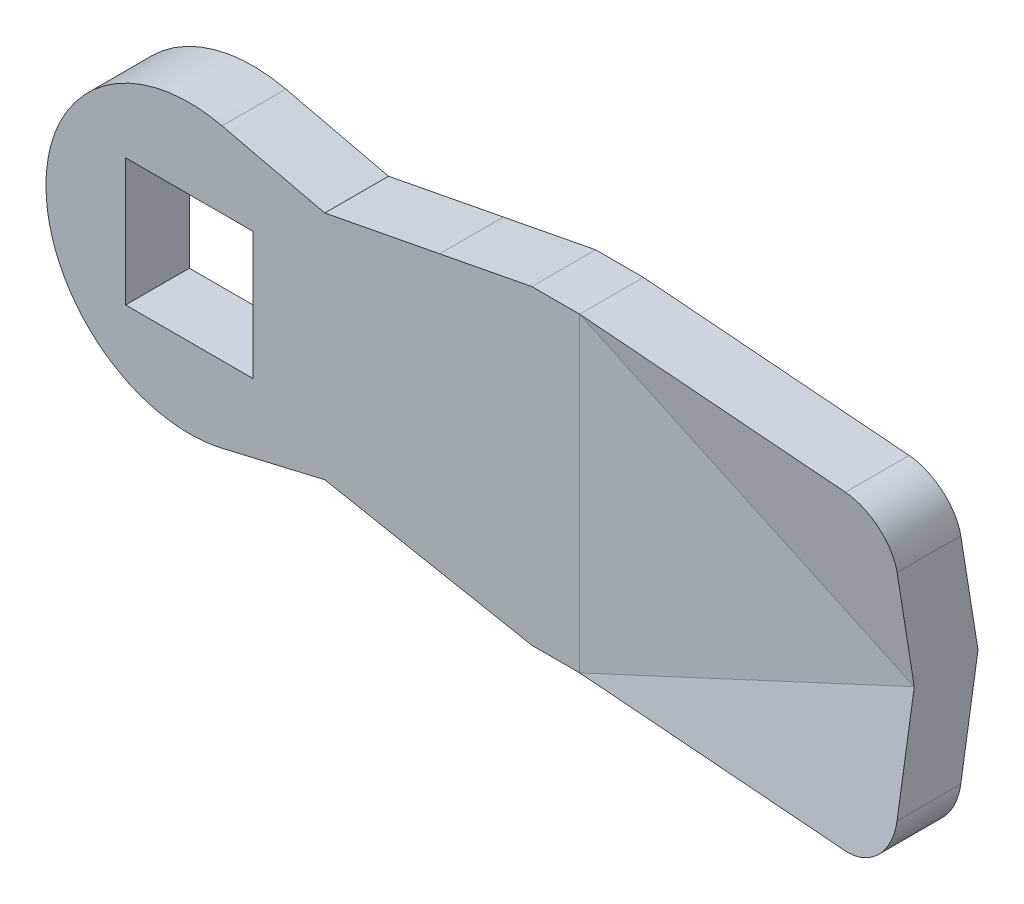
ISO-10303-21;
HEADER;
FILE_DESCRIPTION(('STEP AP214'),'2;1');
FILE_NAME('part.step','',(''),(''),'','','');
FILE_SCHEMA(('AUTOMOTIVE_DESIGN { 1 0 10303 214 1 1 1 1 }'));
ENDSEC;
DATA;
#1=APPLICATION_CONTEXT('core data for automotive mechanical design processes');
#2=APPLICATION_PROTOCOL_DEFINITION('international standard','automotive_design',2000,#1);
#3=PRODUCT_CONTEXT('',#1,'mechanical');
#4=PRODUCT('Part','Part','',(#3));
#5=PRODUCT_RELATED_PRODUCT_CATEGORY('part','',(#4));
#6=PRODUCT_DEFINITION_FORMATION('','',#4);
#7=PRODUCT_DEFINITION_CONTEXT('part definition',#1,'design');
#8=PRODUCT_DEFINITION('design','',#6,#7);
#9=PRODUCT_DEFINITION_SHAPE('','',#8);
#10=(LENGTH_UNIT() NAMED_UNIT(*) SI_UNIT(.MILLI.,.METRE.));
#11=(NAMED_UNIT(*) PLANE_ANGLE_UNIT() SI_UNIT($,.RADIAN.));
#12=(NAMED_UNIT(*) SI_UNIT($,.STERADIAN.) SOLID_ANGLE_UNIT());
#13=UNCERTAINTY_MEASURE_WITH_UNIT(LENGTH_MEASURE(1.E-05),#10,'distance_accuracy_value','');
#14=(GEOMETRIC_REPRESENTATION_CONTEXT(3) GLOBAL_UNCERTAINTY_ASSIGNED_CONTEXT((#13)) GLOBAL_UNIT_ASSIGNED_CONTEXT((#10,
#11,#12)) REPRESENTATION_CONTEXT('',''));
#15=CARTESIAN_POINT('',(0.,0.,0.));
#16=DIRECTION('',(0.,0.,1.));
#17=DIRECTION('',(1.,0.,0.));
#18=AXIS2_PLACEMENT_3D('',#15,#16,#17);
#19=CARTESIAN_POINT('',(9.,0.,-2.5));
#20=DIRECTION('',(0.,0.,1.));
#21=DIRECTION('',(1.,0.,0.));
#22=AXIS2_PLACEMENT_3D('',#19,#20,#21);
#23=PLANE('',#22);
#24=CARTESIAN_POINT('',(11.5,-3.,-2.5));
#25=DIRECTION('',(-1.,0.,0.));
#26=VECTOR('',#25,1.);
#27=LINE('',#24,#26);
#28=CARTESIAN_POINT('',(11.5,-3.,-2.5));
#29=VERTEX_POINT('',#28);
#30=CARTESIAN_POINT('',(6.5,-3.,-2.5));
#31=VERTEX_POINT('',#30);
#32=EDGE_CURVE('E182',#29,#31,#27,.T.);
#33=ORIENTED_EDGE('',*,*,#32,.T.);
#34=CARTESIAN_POINT('',(6.5,-3.,-2.5));
#35=DIRECTION('',(0.,1.,0.));
#36=VECTOR('',#35,1.);
#37=LINE('',#34,#36);
#38=CARTESIAN_POINT('',(6.5,3.,-2.5));
#39=VERTEX_POINT('',#38);
#40=EDGE_CURVE('E174',#31,#39,#37,.T.);
#41=ORIENTED_EDGE('',*,*,#40,.T.);
#42=CARTESIAN_POINT('',(6.5,3.,-2.5));
#43=DIRECTION('',(1.,0.,0.));
#44=VECTOR('',#43,1.);
#45=LINE('',#42,#44);
#46=CARTESIAN_POINT('',(11.5,3.,-2.5));
#47=VERTEX_POINT('',#46);
#48=EDGE_CURVE('E178',#39,#47,#45,.T.);
#49=ORIENTED_EDGE('',*,*,#48,.T.);
#50=CARTESIAN_POINT('',(11.5,3.,-2.5));
#51=DIRECTION('',(0.,-1.,0.));
#52=VECTOR('',#51,1.);
#53=LINE('',#50,#52);
#54=EDGE_CURVE('E1405',#47,#29,#53,.T.);
#55=ORIENTED_EDGE('',*,*,#54,.T.);
#56=EDGE_LOOP('',(#33,#41,#49,#55));
#57=FACE_BOUND('',#56,.T.);
#58=ADVANCED_FACE('F16',(#57),#23,.F.);
#59=CARTESIAN_POINT('',(6.5,0.,-1.25));
#60=DIRECTION('',(1.,0.,0.));
#61=DIRECTION('',(0.,1.,0.));
#62=AXIS2_PLACEMENT_3D('',#59,#60,#61);
#63=PLANE('',#62);
#64=ORIENTED_EDGE('',*,*,#40,.F.);
#65=CARTESIAN_POINT('',(6.5,-3.,-2.5));
#66=DIRECTION('',(0.,0.,1.));
#67=VECTOR('',#66,1.);
#68=LINE('',#65,#67);
#69=CARTESIAN_POINT('',(6.5,-3.,0.));
#70=VERTEX_POINT('',#69);
#71=EDGE_CURVE('E254',#31,#70,#68,.T.);
#72=ORIENTED_EDGE('',*,*,#71,.T.);
#73=CARTESIAN_POINT('',(6.5,-3.,0.));
#74=DIRECTION('',(0.,1.,0.));
#75=VECTOR('',#74,1.);
#76=LINE('',#73,#75);
#77=CARTESIAN_POINT('',(6.5,3.,0.));
#78=VERTEX_POINT('',#77);
#79=EDGE_CURVE('E195',#70,#78,#76,.T.);
#80=ORIENTED_EDGE('',*,*,#79,.T.);
#81=CARTESIAN_POINT('',(6.5,3.,0.));
#82=DIRECTION('',(0.,0.,-1.));
#83=VECTOR('',#82,1.);
#84=LINE('',#81,#83);
#85=EDGE_CURVE('E188',#78,#39,#84,.T.);
#86=ORIENTED_EDGE('',*,*,#85,.T.);
#87=EDGE_LOOP('',(#64,#72,#80,#86));
#88=FACE_BOUND('',#87,.T.);
#89=ADVANCED_FACE('F193',(#88),#63,.F.);
#90=CARTESIAN_POINT('',(9.,3.,-1.25));
#91=DIRECTION('',(0.,-1.,0.));
#92=DIRECTION('',(0.,0.,-1.));
#93=AXIS2_PLACEMENT_3D('',#90,#91,#92);
#94=PLANE('',#93);
#95=ORIENTED_EDGE('',*,*,#48,.F.);
#96=ORIENTED_EDGE('',*,*,#85,.F.);
#97=CARTESIAN_POINT('',(6.5,3.,0.));
#98=DIRECTION('',(1.,0.,0.));
#99=VECTOR('',#98,1.);
#100=LINE('',#97,#99);
#101=CARTESIAN_POINT('',(11.5,3.,0.));
#102=VERTEX_POINT('',#101);
#103=EDGE_CURVE('E292',#78,#102,#100,.T.);
#104=ORIENTED_EDGE('',*,*,#103,.T.);
#105=CARTESIAN_POINT('',(11.5,3.,0.));
#106=DIRECTION('',(0.,0.,-1.));
#107=VECTOR('',#106,1.);
#108=LINE('',#105,#107);
#109=EDGE_CURVE('E206',#102,#47,#108,.T.);
#110=ORIENTED_EDGE('',*,*,#109,.T.);
#111=EDGE_LOOP('',(#95,#96,#104,#110));
#112=FACE_BOUND('',#111,.T.);
#113=ADVANCED_FACE('F204',(#112),#94,.F.);
#114=CARTESIAN_POINT('',(11.5,0.,-1.25));
#115=DIRECTION('',(-1.,0.,0.));
#116=DIRECTION('',(0.,0.,1.));
#117=AXIS2_PLACEMENT_3D('',#114,#115,#116);
#118=PLANE('',#117);
#119=ORIENTED_EDGE('',*,*,#54,.F.);
#120=ORIENTED_EDGE('',*,*,#109,.F.);
#121=CARTESIAN_POINT('',(11.5,3.,0.));
#122=DIRECTION('',(0.,-1.,0.));
#123=VECTOR('',#122,1.);
#124=LINE('',#121,#123);
#125=CARTESIAN_POINT('',(11.5,-3.,0.));
#126=VERTEX_POINT('',#125);
#127=EDGE_CURVE('E287',#102,#126,#124,.T.);
#128=ORIENTED_EDGE('',*,*,#127,.T.);
#129=CARTESIAN_POINT('',(11.5,-3.,0.));
#130=DIRECTION('',(0.,0.,-1.));
#131=VECTOR('',#130,1.);
#132=LINE('',#129,#131);
#133=EDGE_CURVE('E280',#126,#29,#132,.T.);
#134=ORIENTED_EDGE('',*,*,#133,.T.);
#135=EDGE_LOOP('',(#119,#120,#128,#134));
#136=FACE_BOUND('',#135,.T.);
#137=ADVANCED_FACE('F226',(#136),#118,.F.);
#138=CARTESIAN_POINT('',(9.,-3.,-1.25));
#139=DIRECTION('',(0.,1.,0.));
#140=DIRECTION('',(1.,0.,0.));
#141=AXIS2_PLACEMENT_3D('',#138,#139,#140);
#142=PLANE('',#141);
#143=ORIENTED_EDGE('',*,*,#32,.F.);
#144=ORIENTED_EDGE('',*,*,#133,.F.);
#145=CARTESIAN_POINT('',(11.5,-3.,0.));
#146=DIRECTION('',(-1.,0.,0.));
#147=VECTOR('',#146,1.);
#148=LINE('',#145,#147);
#149=EDGE_CURVE('E276',#126,#70,#148,.T.);
#150=ORIENTED_EDGE('',*,*,#149,.T.);
#151=ORIENTED_EDGE('',*,*,#71,.F.);
#152=EDGE_LOOP('',(#143,#144,#150,#151));
#153=FACE_BOUND('',#152,.T.);
#154=ADVANCED_FACE('F278',(#153),#142,.F.);
#155=CARTESIAN_POINT('',(-4.,0.,3.));
#156=DIRECTION('',(1.,0.,0.));
#157=DIRECTION('',(0.,1.,0.));
#158=AXIS2_PLACEMENT_3D('',#155,#156,#157);
#159=PLANE('',#158);
#160=CARTESIAN_POINT('',(-4.,-4.,0.));
#161=DIRECTION('',(0.,1.,0.));
#162=VECTOR('',#161,1.);
#163=LINE('',#160,#162);
#164=CARTESIAN_POINT('',(-4.,-4.,0.));
#165=VERTEX_POINT('',#164);
#166=CARTESIAN_POINT('',(-4.,4.,0.));
#167=VERTEX_POINT('',#166);
#168=EDGE_CURVE('E286',#165,#167,#163,.T.);
#169=ORIENTED_EDGE('',*,*,#168,.T.);
#170=CARTESIAN_POINT('',(-4.,4.,4.));
#171=DIRECTION('',(0.,0.,-1.));
#172=VECTOR('',#171,1.);
#173=LINE('',#170,#172);
#174=CARTESIAN_POINT('',(-4.,4.,4.));
#175=VERTEX_POINT('',#174);
#176=EDGE_CURVE('E273',#175,#167,#173,.T.);
#177=ORIENTED_EDGE('',*,*,#176,.F.);
#178=CARTESIAN_POINT('',(-4.,-4.,4.));
#179=DIRECTION('',(0.,1.,0.));
#180=VECTOR('',#179,1.);
#181=LINE('',#178,#180);
#182=CARTESIAN_POINT('',(-4.,-4.,4.));
#183=VERTEX_POINT('',#182);
#184=EDGE_CURVE('E1062',#183,#175,#181,.T.);
#185=ORIENTED_EDGE('',*,*,#184,.F.);
#186=CARTESIAN_POINT('',(-4.,-4.,0.));
#187=DIRECTION('',(0.,0.,1.));
#188=VECTOR('',#187,1.);
#189=LINE('',#186,#188);
#190=EDGE_CURVE('E963',#165,#183,#189,.T.);
#191=ORIENTED_EDGE('',*,*,#190,.F.);
#192=EDGE_LOOP('',(#169,#177,#185,#191));
#193=FACE_BOUND('',#192,.T.);
#194=ADVANCED_FACE('F1067',(#193),#159,.T.);
#195=CARTESIAN_POINT('',(0.,4.,3.));
#196=DIRECTION('',(0.,-1.,0.));
#197=DIRECTION('',(0.,0.,-1.));
#198=AXIS2_PLACEMENT_3D('',#195,#196,#197);
#199=PLANE('',#198);
#200=CARTESIAN_POINT('',(-4.,4.,0.));
#201=DIRECTION('',(1.,0.,0.));
#202=VECTOR('',#201,1.);
#203=LINE('',#200,#202);
#204=CARTESIAN_POINT('',(4.,4.,0.));
#205=VERTEX_POINT('',#204);
#206=EDGE_CURVE('E1041',#167,#205,#203,.T.);
#207=ORIENTED_EDGE('',*,*,#206,.T.);
#208=CARTESIAN_POINT('',(4.,4.,4.));
#209=DIRECTION('',(0.,0.,-1.));
#210=VECTOR('',#209,1.);
#211=LINE('',#208,#210);
#212=CARTESIAN_POINT('',(4.,4.,4.));
#213=VERTEX_POINT('',#212);
#214=EDGE_CURVE('E1051',#213,#205,#211,.T.);
#215=ORIENTED_EDGE('',*,*,#214,.F.);
#216=CARTESIAN_POINT('',(-4.,4.,4.));
#217=DIRECTION('',(1.,0.,0.));
#218=VECTOR('',#217,1.);
#219=LINE('',#216,#218);
#220=EDGE_CURVE('E1020',#175,#213,#219,.T.);
#221=ORIENTED_EDGE('',*,*,#220,.F.);
#222=ORIENTED_EDGE('',*,*,#176,.T.);
#223=EDGE_LOOP('',(#207,#215,#221,#222));
#224=FACE_BOUND('',#223,.T.);
#225=ADVANCED_FACE('F989',(#224),#199,.T.);
#226=CARTESIAN_POINT('',(4.,0.,3.));
#227=DIRECTION('',(-1.,0.,0.));
#228=DIRECTION('',(0.,0.,1.));
#229=AXIS2_PLACEMENT_3D('',#226,#227,#228);
#230=PLANE('',#229);
#231=CARTESIAN_POINT('',(4.,4.,0.));
#232=DIRECTION('',(0.,-1.,0.));
#233=VECTOR('',#232,1.);
#234=LINE('',#231,#233);
#235=CARTESIAN_POINT('',(4.,-4.,0.));
#236=VERTEX_POINT('',#235);
#237=EDGE_CURVE('E1164',#205,#236,#234,.T.);
#238=ORIENTED_EDGE('',*,*,#237,.T.);
#239=CARTESIAN_POINT('',(4.,-4.,4.));
#240=DIRECTION('',(0.,0.,-1.));
#241=VECTOR('',#240,1.);
#242=LINE('',#239,#241);
#243=CARTESIAN_POINT('',(4.,-4.,4.));
#244=VERTEX_POINT('',#243);
#245=EDGE_CURVE('E941',#244,#236,#242,.T.);
#246=ORIENTED_EDGE('',*,*,#245,.F.);
#247=CARTESIAN_POINT('',(4.,4.,4.));
#248=DIRECTION('',(0.,-1.,0.));
#249=VECTOR('',#248,1.);
#250=LINE('',#247,#249);
#251=EDGE_CURVE('E568',#213,#244,#250,.T.);
#252=ORIENTED_EDGE('',*,*,#251,.F.);
#253=ORIENTED_EDGE('',*,*,#214,.T.);
#254=EDGE_LOOP('',(#238,#246,#252,#253));
#255=FACE_BOUND('',#254,.T.);
#256=ADVANCED_FACE('F980',(#255),#230,.T.);
#257=CARTESIAN_POINT('',(0.,-4.,3.));
#258=DIRECTION('',(0.,1.,0.));
#259=DIRECTION('',(1.,0.,0.));
#260=AXIS2_PLACEMENT_3D('',#257,#258,#259);
#261=PLANE('',#260);
#262=CARTESIAN_POINT('',(4.,-4.,0.));
#263=DIRECTION('',(-1.,0.,0.));
#264=VECTOR('',#263,1.);
#265=LINE('',#262,#264);
#266=EDGE_CURVE('E952',#236,#165,#265,.T.);
#267=ORIENTED_EDGE('',*,*,#266,.T.);
#268=ORIENTED_EDGE('',*,*,#190,.T.);
#269=CARTESIAN_POINT('',(4.,-4.,4.));
#270=DIRECTION('',(-1.,0.,0.));
#271=VECTOR('',#270,1.);
#272=LINE('',#269,#271);
#273=EDGE_CURVE('E930',#244,#183,#272,.T.);
#274=ORIENTED_EDGE('',*,*,#273,.F.);
#275=ORIENTED_EDGE('',*,*,#245,.T.);
#276=EDGE_LOOP('',(#267,#268,#274,#275));
#277=FACE_BOUND('',#276,.T.);
#278=ADVANCED_FACE('F898',(#277),#261,.T.);
#279=CARTESIAN_POINT('',(18.605940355,-9.19345007,-30.));
#280=DIRECTION('',(0.188847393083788,0.982006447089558,0.));
#281=DIRECTION('',(0.,0.,-1.));
#282=AXIS2_PLACEMENT_3D('',#279,#280,#281);
#283=PLANE('',#282);
#284=CARTESIAN_POINT('',(21.5,-9.75,0.));
#285=DIRECTION('',(0.,0.,1.));
#286=VECTOR('',#285,1.);
#287=LINE('',#284,#286);
#288=CARTESIAN_POINT('',(21.5,-9.75,0.));
#289=VERTEX_POINT('',#288);
#290=CARTESIAN_POINT('',(21.5,-9.75,4.));
#291=VERTEX_POINT('',#290);
#292=EDGE_CURVE('E846',#289,#291,#287,.T.);
#293=ORIENTED_EDGE('',*,*,#292,.T.);
#294=CARTESIAN_POINT('',(15.71188071,-8.63690014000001,4.));
#295=DIRECTION('',(0.982006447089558,-0.188847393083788,0.));
#296=VECTOR('',#295,1.);
#297=LINE('',#294,#296);
#298=CARTESIAN_POINT('',(15.7118807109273,-8.63690013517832,4.));
#299=VERTEX_POINT('',#298);
#300=EDGE_CURVE('E1123',#299,#291,#297,.T.);
#301=ORIENTED_EDGE('',*,*,#300,.F.);
#302=CARTESIAN_POINT('',(15.7118807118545,-8.63690013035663,0.));
#303=DIRECTION('',(0.,0.,1.));
#304=VECTOR('',#303,1.);
#305=LINE('',#302,#304);
#306=CARTESIAN_POINT('',(15.7118807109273,-8.63690013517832,0.));
#307=VERTEX_POINT('',#306);
#308=EDGE_CURVE('E589',#307,#299,#305,.T.);
#309=ORIENTED_EDGE('',*,*,#308,.F.);
#310=CARTESIAN_POINT('',(15.71188071,-8.63690014,0.));
#311=DIRECTION('',(0.982006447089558,-0.188847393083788,0.));
#312=VECTOR('',#311,1.);
#313=LINE('',#310,#312);
#314=EDGE_CURVE('E917',#307,#289,#313,.T.);
#315=ORIENTED_EDGE('',*,*,#314,.T.);
#316=EDGE_LOOP('',(#293,#301,#309,#315));
#317=FACE_BOUND('',#316,.T.);
#318=ADVANCED_FACE('F889',(#317),#283,.F.);
#319=CARTESIAN_POINT('',(24.5,-9.75,-30.));
#320=DIRECTION('',(0.,1.,0.));
#321=DIRECTION('',(1.,0.,0.));
#322=AXIS2_PLACEMENT_3D('',#319,#320,#321);
#323=PLANE('',#322);
#324=CARTESIAN_POINT('',(24.5,-9.75,4.));
#325=DIRECTION('',(0.,0.,-1.));
#326=VECTOR('',#325,1.);
#327=LINE('',#324,#326);
#328=CARTESIAN_POINT('',(24.5,-9.75,4.));
#329=VERTEX_POINT('',#328);
#330=CARTESIAN_POINT('',(24.5,-9.75,0.));
#331=VERTEX_POINT('',#330);
#332=EDGE_CURVE('E51',#329,#331,#327,.T.);
#333=ORIENTED_EDGE('',*,*,#332,.F.);
#334=CARTESIAN_POINT('',(21.5,-9.75,4.));
#335=DIRECTION('',(1.,0.,0.));
#336=VECTOR('',#335,1.);
#337=LINE('',#334,#336);
#338=EDGE_CURVE('E856',#291,#329,#337,.T.);
#339=ORIENTED_EDGE('',*,*,#338,.F.);
#340=ORIENTED_EDGE('',*,*,#292,.F.);
#341=CARTESIAN_POINT('',(21.5,-9.75,0.));
#342=DIRECTION('',(1.,0.,0.));
#343=VECTOR('',#342,1.);
#344=LINE('',#341,#343);
#345=EDGE_CURVE('E874',#289,#331,#344,.T.);
#346=ORIENTED_EDGE('',*,*,#345,.T.);
#347=EDGE_LOOP('',(#333,#339,#340,#346));
#348=FACE_BOUND('',#347,.T.);
#349=ADVANCED_FACE('F817',(#348),#323,.F.);
#350=CARTESIAN_POINT('',(12.105940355,7.94345007,0.));
#351=DIRECTION('',(-0.188847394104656,0.982006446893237,0.));
#352=DIRECTION('',(0.,0.,1.));
#353=AXIS2_PLACEMENT_3D('',#350,#351,#352);
#354=PLANE('',#353);
#355=CARTESIAN_POINT('',(15.71188071,8.63690014,0.));
#356=DIRECTION('',(-0.982006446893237,-0.188847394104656,0.));
#357=VECTOR('',#356,1.);
#358=LINE('',#355,#357);
#359=CARTESIAN_POINT('',(15.71188071,8.63690014,0.));
#360=VERTEX_POINT('',#359);
#361=CARTESIAN_POINT('',(8.5,7.25,0.));
#362=VERTEX_POINT('',#361);
#363=EDGE_CURVE('E1153',#360,#362,#358,.T.);
#364=ORIENTED_EDGE('',*,*,#363,.T.);
#365=CARTESIAN_POINT('',(8.5,7.25,4.));
#366=DIRECTION('',(0.,0.,-1.));
#367=VECTOR('',#366,1.);
#368=LINE('',#365,#367);
#369=CARTESIAN_POINT('',(8.5,7.25,4.));
#370=VERTEX_POINT('',#369);
#371=EDGE_CURVE('E771',#370,#362,#368,.T.);
#372=ORIENTED_EDGE('',*,*,#371,.F.);
#373=CARTESIAN_POINT('',(15.71188071,8.63690014,4.));
#374=DIRECTION('',(-0.982006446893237,-0.188847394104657,0.));
#375=VECTOR('',#374,1.);
#376=LINE('',#373,#375);
#377=CARTESIAN_POINT('',(15.71188071,8.63690014,4.));
#378=VERTEX_POINT('',#377);
#379=EDGE_CURVE('E803',#378,#370,#376,.T.);
#380=ORIENTED_EDGE('',*,*,#379,.F.);
#381=CARTESIAN_POINT('',(15.71188071,8.63690014,4.));
#382=DIRECTION('',(0.,0.,-1.));
#383=VECTOR('',#382,1.);
#384=LINE('',#381,#383);
#385=EDGE_CURVE('E295',#378,#360,#384,.T.);
#386=ORIENTED_EDGE('',*,*,#385,.T.);
#387=EDGE_LOOP('',(#364,#372,#380,#386));
#388=FACE_BOUND('',#387,.T.);
#389=ADVANCED_FACE('F808',(#388),#354,.T.);
#390=CARTESIAN_POINT('',(5.277956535,8.006016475,0.));
#391=DIRECTION('',(0.22843478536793,0.973559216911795,0.));
#392=DIRECTION('',(0.,0.,-1.));
#393=AXIS2_PLACEMENT_3D('',#390,#391,#392);
#394=PLANE('',#393);
#395=CARTESIAN_POINT('',(8.5,7.25,0.));
#396=DIRECTION('',(-0.973559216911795,0.22843478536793,0.));
#397=VECTOR('',#396,1.);
#398=LINE('',#395,#397);
#399=CARTESIAN_POINT('',(2.05591307,8.76203295,0.));
#400=VERTEX_POINT('',#399);
#401=EDGE_CURVE('E782',#362,#400,#398,.T.);
#402=ORIENTED_EDGE('',*,*,#401,.T.);
#403=CARTESIAN_POINT('',(2.05591307,8.76203295,4.));
#404=DIRECTION('',(0.,0.,-1.));
#405=VECTOR('',#404,1.);
#406=LINE('',#403,#405);
#407=CARTESIAN_POINT('',(2.05591307,8.76203295,4.));
#408=VERTEX_POINT('',#407);
#409=EDGE_CURVE('E792',#408,#400,#406,.T.);
#410=ORIENTED_EDGE('',*,*,#409,.F.);
#411=CARTESIAN_POINT('',(8.5,7.25,4.));
#412=DIRECTION('',(-0.973559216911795,0.22843478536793,0.));
#413=VECTOR('',#412,1.);
#414=LINE('',#411,#413);
#415=EDGE_CURVE('E760',#370,#408,#414,.T.);
#416=ORIENTED_EDGE('',*,*,#415,.F.);
#417=ORIENTED_EDGE('',*,*,#371,.T.);
#418=EDGE_LOOP('',(#402,#410,#416,#417));
#419=FACE_BOUND('',#418,.T.);
#420=ADVANCED_FACE('F725',(#419),#394,.T.);
#421=CARTESIAN_POINT('',(-1.43440992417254E-09,0.,0.));
#422=DIRECTION('',(0.,0.,1.));
#423=DIRECTION('',(0.228434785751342,0.973559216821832,0.));
#424=AXIS2_PLACEMENT_3D('',#421,#422,#423);
#425=CYLINDRICAL_SURFACE('',#424,8.99999999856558);
#426=ORIENTED_EDGE('',*,*,#409,.T.);
#427=CARTESIAN_POINT('',(-1.43440992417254E-09,0.,0.));
#428=DIRECTION('',(0.,0.,1.));
#429=DIRECTION('',(0.228434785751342,0.973559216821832,0.));
#430=AXIS2_PLACEMENT_3D('',#427,#428,#429);
#431=CIRCLE('',#430,8.99999999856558);
#432=CARTESIAN_POINT('',(-2.05591307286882,-8.76203295,0.));
#433=VERTEX_POINT('',#432);
#434=EDGE_CURVE('E746',#400,#433,#431,.T.);
#435=ORIENTED_EDGE('',*,*,#434,.T.);
#436=CARTESIAN_POINT('',(-2.0559130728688,-8.76203295,4.));
#437=DIRECTION('',(0.,0.,-1.));
#438=VECTOR('',#437,1.);
#439=LINE('',#436,#438);
#440=CARTESIAN_POINT('',(-2.05591307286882,-8.76203295,4.));
#441=VERTEX_POINT('',#440);
#442=EDGE_CURVE('E668',#441,#433,#439,.T.);
#443=ORIENTED_EDGE('',*,*,#442,.F.);
#444=CARTESIAN_POINT('',(2.05591307,8.76203295,4.));
#445=CARTESIAN_POINT('',(1.1931985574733,8.96445926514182,4.));
#446=CARTESIAN_POINT('',(0.30702144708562,8.9947616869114,4.));
#447=CARTESIAN_POINT('',(-0.5783337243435,9.02503600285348,4.));
#448=CARTESIAN_POINT('',(-1.45366883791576,8.88182677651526,4.));
#449=CARTESIAN_POINT('',(-2.32791838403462,8.73879515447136,4.));
#450=CARTESIAN_POINT('',(-3.15849544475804,8.42756824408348,4.));
#451=CARTESIAN_POINT('',(-3.98804244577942,8.11672730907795,4.));
#452=CARTESIAN_POINT('',(-4.74194284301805,7.6494429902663,4.));
#453=CARTESIAN_POINT('',(-5.49490827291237,7.1827381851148,4.));
#454=CARTESIAN_POINT('',(-6.14316003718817,6.57735393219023,4.));
#455=CARTESIAN_POINT('',(-6.79060785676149,5.97272046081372,4.));
#456=CARTESIAN_POINT('',(-7.30829903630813,5.25250085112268,4.));
#457=CARTESIAN_POINT('',(-7.82534818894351,4.53317443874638,4.));
#458=CARTESIAN_POINT('',(-8.19258420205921,3.72579710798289,4.));
#459=CARTESIAN_POINT('',(-8.55936477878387,2.91942106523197,4.));
#460=CARTESIAN_POINT('',(-8.76203295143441,2.05591307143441,4.));
#461=CARTESIAN_POINT('',(-8.96444978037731,1.19347597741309,4.));
#462=CARTESIAN_POINT('',(-8.99476168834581,0.307021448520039,4.));
#463=CARTESIAN_POINT('',(-9.02503600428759,-0.578333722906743,4.));
#464=CARTESIAN_POINT('',(-8.88182677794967,-1.45366883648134,4.));
#465=CARTESIAN_POINT('',(-8.73879515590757,-2.32791838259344,4.));
#466=CARTESIAN_POINT('',(-8.42756824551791,-3.15849544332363,4.));
#467=CARTESIAN_POINT('',(-8.11672731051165,-3.98804244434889,4.));
#468=CARTESIAN_POINT('',(-7.64944299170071,-4.74194284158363,4.));
#469=CARTESIAN_POINT('',(-7.18273818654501,-5.494908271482,4.));
#470=CARTESIAN_POINT('',(-6.57735393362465,-6.14316003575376,4.));
#471=CARTESIAN_POINT('',(-5.97272046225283,-6.7906078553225,4.));
#472=CARTESIAN_POINT('',(-5.25250085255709,-7.30829903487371,4.));
#473=CARTESIAN_POINT('',(-4.53317444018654,-7.82534818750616,4.));
#474=CARTESIAN_POINT('',(-3.7257971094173,-8.19258420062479,4.));
#475=CARTESIAN_POINT('',(-2.91916823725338,-8.55947977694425,4.));
#476=CARTESIAN_POINT('',(-2.05591307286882,-8.76203295,4.));
#477=B_SPLINE_CURVE_WITH_KNOTS('',2,(#444,#445,#446,#447,#448,#449,#450,#451,#452,#453,#454,
#455,#456,#457,#458,#459,#460,#461,#462,#463,#464,#465,#466,#467,#468,#469,#470,#471,#472,#473,
#474,#475,#476),.UNSPECIFIED.,.F.,.F.,(3,2,2,2,2,2,2,2,2,2,2,2,2,2,2,2,3),(0.,0.0625,0.125,
0.1875,0.25,0.3125,0.375,0.4375,0.5,0.5625,0.625,0.6875,0.75,0.8125,0.875,0.9375,1.),.UNSPECIFIED.);
#478=EDGE_CURVE('E1133',#408,#441,#477,.T.);
#479=ORIENTED_EDGE('',*,*,#478,.F.);
#480=EDGE_LOOP('',(#426,#435,#443,#479));
#481=FACE_BOUND('',#480,.T.);
#482=ADVANCED_FACE('F716',(#481),#425,.T.);
#483=CARTESIAN_POINT('',(-1.43440992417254E-09,0.,0.));
#484=DIRECTION('',(0.,0.,1.));
#485=DIRECTION('',(0.228434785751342,0.973559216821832,0.));
#486=AXIS2_PLACEMENT_3D('',#483,#484,#485);
#487=CYLINDRICAL_SURFACE('',#486,8.99999999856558);
#488=CARTESIAN_POINT('',(2.05591307,-8.76203294,4.));
#489=DIRECTION('',(0.,0.,-1.));
#490=VECTOR('',#489,1.);
#491=LINE('',#488,#490);
#492=CARTESIAN_POINT('',(2.05591307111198,-8.76203294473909,4.));
#493=VERTEX_POINT('',#492);
#494=CARTESIAN_POINT('',(2.05591307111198,-8.76203294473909,0.));
#495=VERTEX_POINT('',#494);
#496=EDGE_CURVE('E689',#493,#495,#491,.T.);
#497=ORIENTED_EDGE('',*,*,#496,.F.);
#498=CARTESIAN_POINT('',(-2.05591307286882,-8.76203295,4.));
#499=CARTESIAN_POINT('',(-1.04199998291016,-8.99993632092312,4.));
#500=CARTESIAN_POINT('',(-2.92240190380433E-10,-8.99999999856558,4.));
#501=CARTESIAN_POINT('',(1.04145735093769,-9.00006364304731,4.));
#502=CARTESIAN_POINT('',(2.05591307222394,-8.76203294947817,4.));
#503=B_SPLINE_CURVE_WITH_KNOTS('',2,(#498,#499,#500,#501,#502),.UNSPECIFIED.,.F.,.F.,(3,2,3),
(0.,0.5,1.),.UNSPECIFIED.);
#504=EDGE_CURVE('E699',#441,#493,#503,.T.);
#505=ORIENTED_EDGE('',*,*,#504,.F.);
#506=ORIENTED_EDGE('',*,*,#442,.T.);
#507=CARTESIAN_POINT('',(-1.43440992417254E-09,0.,0.));
#508=DIRECTION('',(0.,0.,1.));
#509=DIRECTION('',(-0.22843478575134,-0.973559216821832,0.));
#510=AXIS2_PLACEMENT_3D('',#507,#508,#509);
#511=CIRCLE('',#510,8.99999999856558);
#512=EDGE_CURVE('E679',#433,#495,#511,.T.);
#513=ORIENTED_EDGE('',*,*,#512,.T.);
#514=EDGE_LOOP('',(#497,#505,#506,#513));
#515=FACE_BOUND('',#514,.T.);
#516=ADVANCED_FACE('F637',(#515),#487,.T.);
#517=CARTESIAN_POINT('',(5.277956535,-8.006016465,0.));
#518=DIRECTION('',(0.22843478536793,-0.973559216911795,0.));
#519=DIRECTION('',(0.,0.,-1.));
#520=AXIS2_PLACEMENT_3D('',#517,#518,#519);
#521=PLANE('',#520);
#522=CARTESIAN_POINT('',(2.05591307,-8.76203294,0.));
#523=DIRECTION('',(0.973559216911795,0.22843478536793,0.));
#524=VECTOR('',#523,1.);
#525=LINE('',#522,#524);
#526=CARTESIAN_POINT('',(8.5,-7.24999999,0.));
#527=VERTEX_POINT('',#526);
#528=EDGE_CURVE('E1511',#495,#527,#525,.T.);
#529=ORIENTED_EDGE('',*,*,#528,.T.);
#530=CARTESIAN_POINT('',(8.5,-7.24999999,4.));
#531=DIRECTION('',(0.,0.,-1.));
#532=VECTOR('',#531,1.);
#533=LINE('',#530,#532);
#534=CARTESIAN_POINT('',(8.5,-7.24999999,4.));
#535=VERTEX_POINT('',#534);
#536=EDGE_CURVE('E609',#535,#527,#533,.T.);
#537=ORIENTED_EDGE('',*,*,#536,.F.);
#538=CARTESIAN_POINT('',(2.05591307,-8.76203294,4.));
#539=DIRECTION('',(0.973559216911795,0.228434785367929,0.));
#540=VECTOR('',#539,1.);
#541=LINE('',#538,#540);
#542=EDGE_CURVE('E622',#493,#535,#541,.T.);
#543=ORIENTED_EDGE('',*,*,#542,.F.);
#544=ORIENTED_EDGE('',*,*,#496,.T.);
#545=EDGE_LOOP('',(#529,#537,#543,#544));
#546=FACE_BOUND('',#545,.T.);
#547=ADVANCED_FACE('F628',(#546),#521,.T.);
#548=CARTESIAN_POINT('',(12.105940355,-7.94345006,0.));
#549=DIRECTION('',(-0.188847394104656,-0.982006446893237,0.));
#550=DIRECTION('',(-0.982006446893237,0.188847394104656,0.));
#551=AXIS2_PLACEMENT_3D('',#548,#549,#550);
#552=PLANE('',#551);
#553=CARTESIAN_POINT('',(8.5,-7.24999999,4.));
#554=DIRECTION('',(0.982006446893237,-0.188847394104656,0.));
#555=VECTOR('',#554,1.);
#556=LINE('',#553,#555);
#557=EDGE_CURVE('E475',#535,#299,#556,.T.);
#558=ORIENTED_EDGE('',*,*,#557,.F.);
#559=ORIENTED_EDGE('',*,*,#536,.T.);
#560=CARTESIAN_POINT('',(8.5,-7.24999999,0.));
#561=DIRECTION('',(0.982006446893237,-0.188847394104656,0.));
#562=VECTOR('',#561,1.);
#563=LINE('',#560,#562);
#564=EDGE_CURVE('E413',#527,#307,#563,.T.);
#565=ORIENTED_EDGE('',*,*,#564,.T.);
#566=ORIENTED_EDGE('',*,*,#308,.T.);
#567=EDGE_LOOP('',(#558,#559,#565,#566));
#568=FACE_BOUND('',#567,.T.);
#569=ADVANCED_FACE('F489',(#568),#552,.T.);
#570=CARTESIAN_POINT('',(4.93826795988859,2.68955124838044E-09,4.));
#571=DIRECTION('',(0.,0.,1.));
#572=DIRECTION('',(1.,0.,0.));
#573=AXIS2_PLACEMENT_3D('',#570,#571,#572);
#574=PLANE('',#573);
#575=ORIENTED_EDGE('',*,*,#220,.T.);
#576=ORIENTED_EDGE('',*,*,#251,.T.);
#577=ORIENTED_EDGE('',*,*,#273,.T.);
#578=ORIENTED_EDGE('',*,*,#184,.T.);
#579=EDGE_LOOP('',(#575,#576,#577,#578));
#580=FACE_BOUND('',#579,.T.);
#581=ORIENTED_EDGE('',*,*,#504,.T.);
#582=ORIENTED_EDGE('',*,*,#542,.T.);
#583=ORIENTED_EDGE('',*,*,#557,.T.);
#584=ORIENTED_EDGE('',*,*,#300,.T.);
#585=ORIENTED_EDGE('',*,*,#338,.T.);
#586=CARTESIAN_POINT('',(24.5,9.75,4.));
#587=DIRECTION('',(0.,-1.,0.));
#588=VECTOR('',#587,1.);
#589=LINE('',#586,#588);
#590=CARTESIAN_POINT('',(24.5,9.75,4.));
#591=VERTEX_POINT('',#590);
#592=EDGE_CURVE('E1482',#591,#329,#589,.T.);
#593=ORIENTED_EDGE('',*,*,#592,.F.);
#594=CARTESIAN_POINT('',(24.5,9.75,4.));
#595=DIRECTION('',(-1.,0.,0.));
#596=VECTOR('',#595,1.);
#597=LINE('',#594,#596);
#598=CARTESIAN_POINT('',(21.5,9.75,4.));
#599=VERTEX_POINT('',#598);
#600=EDGE_CURVE('E1500',#591,#599,#597,.T.);
#601=ORIENTED_EDGE('',*,*,#600,.T.);
#602=CARTESIAN_POINT('',(21.5,9.75,4.));
#603=DIRECTION('',(-0.982006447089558,-0.188847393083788,0.));
#604=VECTOR('',#603,1.);
#605=LINE('',#602,#604);
#606=EDGE_CURVE('E440',#599,#378,#605,.T.);
#607=ORIENTED_EDGE('',*,*,#606,.T.);
#608=ORIENTED_EDGE('',*,*,#379,.T.);
#609=ORIENTED_EDGE('',*,*,#415,.T.);
#610=ORIENTED_EDGE('',*,*,#478,.T.);
#611=EDGE_LOOP('',(#581,#582,#583,#584,#585,#593,#601,#607,#608,#609,#610));
#612=FACE_BOUND('',#611,.T.);
#613=ADVANCED_FACE('F480',(#580,#612),#574,.T.);
#614=CARTESIAN_POINT('',(18.605940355,9.19345007,-30.));
#615=DIRECTION('',(0.188847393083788,-0.982006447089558,0.));
#616=DIRECTION('',(0.,0.,-1.));
#617=AXIS2_PLACEMENT_3D('',#614,#615,#616);
#618=PLANE('',#617);
#619=ORIENTED_EDGE('',*,*,#385,.F.);
#620=ORIENTED_EDGE('',*,*,#606,.F.);
#621=CARTESIAN_POINT('',(21.5,9.75,4.));
#622=DIRECTION('',(0.,0.,-1.));
#623=VECTOR('',#622,1.);
#624=LINE('',#621,#623);
#625=CARTESIAN_POINT('',(21.5,9.75,0.));
#626=VERTEX_POINT('',#625);
#627=EDGE_CURVE('E427',#599,#626,#624,.T.);
#628=ORIENTED_EDGE('',*,*,#627,.T.);
#629=CARTESIAN_POINT('',(21.5,9.75,0.));
#630=DIRECTION('',(-0.982006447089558,-0.188847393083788,0.));
#631=VECTOR('',#630,1.);
#632=LINE('',#629,#631);
#633=EDGE_CURVE('E459',#626,#360,#632,.T.);
#634=ORIENTED_EDGE('',*,*,#633,.T.);
#635=EDGE_LOOP('',(#619,#620,#628,#634));
#636=FACE_BOUND('',#635,.T.);
#637=ADVANCED_FACE('F315',(#636),#618,.F.);
#638=CARTESIAN_POINT('',(4.93826795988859,2.68955109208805E-09,0.));
#639=DIRECTION('',(0.,0.,1.));
#640=DIRECTION('',(1.,0.,0.));
#641=AXIS2_PLACEMENT_3D('',#638,#639,#640);
#642=PLANE('',#641);
#643=ORIENTED_EDGE('',*,*,#528,.F.);
#644=ORIENTED_EDGE('',*,*,#512,.F.);
#645=ORIENTED_EDGE('',*,*,#434,.F.);
#646=ORIENTED_EDGE('',*,*,#401,.F.);
#647=ORIENTED_EDGE('',*,*,#363,.F.);
#648=ORIENTED_EDGE('',*,*,#633,.F.);
#649=CARTESIAN_POINT('',(21.5,9.75,0.));
#650=DIRECTION('',(1.,0.,0.));
#651=VECTOR('',#650,1.);
#652=LINE('',#649,#651);
#653=CARTESIAN_POINT('',(24.5,9.75,0.));
#654=VERTEX_POINT('',#653);
#655=EDGE_CURVE('E1486',#626,#654,#652,.T.);
#656=ORIENTED_EDGE('',*,*,#655,.T.);
#657=CARTESIAN_POINT('',(24.5,9.75,0.));
#658=DIRECTION('',(0.,-1.,0.));
#659=VECTOR('',#658,1.);
#660=LINE('',#657,#659);
#661=EDGE_CURVE('E28',#654,#331,#660,.T.);
#662=ORIENTED_EDGE('',*,*,#661,.T.);
#663=ORIENTED_EDGE('',*,*,#345,.F.);
#664=ORIENTED_EDGE('',*,*,#314,.F.);
#665=ORIENTED_EDGE('',*,*,#564,.F.);
#666=EDGE_LOOP('',(#643,#644,#645,#646,#647,#648,#656,#662,#663,#664,#665));
#667=FACE_BOUND('',#666,.T.);
#668=ORIENTED_EDGE('',*,*,#237,.F.);
#669=ORIENTED_EDGE('',*,*,#206,.F.);
#670=ORIENTED_EDGE('',*,*,#168,.F.);
#671=ORIENTED_EDGE('',*,*,#266,.F.);
#672=EDGE_LOOP('',(#668,#669,#670,#671));
#673=FACE_BOUND('',#672,.T.);
#674=ORIENTED_EDGE('',*,*,#127,.F.);
#675=ORIENTED_EDGE('',*,*,#103,.F.);
#676=ORIENTED_EDGE('',*,*,#79,.F.);
#677=ORIENTED_EDGE('',*,*,#149,.F.);
#678=EDGE_LOOP('',(#674,#675,#676,#677));
#679=FACE_BOUND('',#678,.T.);
#680=ADVANCED_FACE('F291',(#667,#673,#679),#642,.F.);
#681=CARTESIAN_POINT('',(24.5,9.75,-30.));
#682=DIRECTION('',(0.,-1.,0.));
#683=DIRECTION('',(0.,0.,-1.));
#684=AXIS2_PLACEMENT_3D('',#681,#682,#683);
#685=PLANE('',#684);
#686=ORIENTED_EDGE('',*,*,#627,.F.);
#687=ORIENTED_EDGE('',*,*,#600,.F.);
#688=CARTESIAN_POINT('',(24.5,9.75,0.));
#689=DIRECTION('',(0.,0.,1.));
#690=VECTOR('',#689,1.);
#691=LINE('',#688,#690);
#692=EDGE_CURVE('E1471',#654,#591,#691,.T.);
#693=ORIENTED_EDGE('',*,*,#692,.F.);
#694=ORIENTED_EDGE('',*,*,#655,.F.);
#695=EDGE_LOOP('',(#686,#687,#693,#694));
#696=FACE_BOUND('',#695,.T.);
#697=ADVANCED_FACE('F314',(#696),#685,.F.);
#698=CARTESIAN_POINT('',(36.,0.,4.));
#699=DIRECTION('',(0.,0.,1.));
#700=DIRECTION('',(1.,0.,0.));
#701=AXIS2_PLACEMENT_3D('',#698,#699,#700);
#702=PLANE('',#701);
#703=CARTESIAN_POINT('',(24.5,9.75000000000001,4.));
#704=DIRECTION('',(0.907008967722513,-0.421111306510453,0.));
#705=VECTOR('',#704,1.);
#706=LINE('',#703,#705);
#707=CARTESIAN_POINT('',(45.4999999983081,0.,4.0000000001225));
#708=VERTEX_POINT('',#707);
#709=EDGE_CURVE('E1485',#591,#708,#706,.T.);
#710=ORIENTED_EDGE('',*,*,#709,.F.);
#711=ORIENTED_EDGE('',*,*,#592,.T.);
#712=CARTESIAN_POINT('',(45.4999999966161,0.,4.));
#713=DIRECTION('',(-0.907008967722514,-0.421111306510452,0.));
#714=VECTOR('',#713,1.);
#715=LINE('',#712,#714);
#716=EDGE_CURVE('E1839',#708,#329,#715,.T.);
#717=ORIENTED_EDGE('',*,*,#716,.F.);
#718=EDGE_LOOP('',(#710,#711,#717));
#719=FACE_BOUND('',#718,.T.);
#720=ADVANCED_FACE('F1809',(#719),#702,.T.);
#721=CARTESIAN_POINT('',(39.2716939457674,8.32058902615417,4.8682408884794));
#722=DIRECTION('',(-0.073125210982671,-0.157500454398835,0.984807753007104));
#723=DIRECTION('',(-0.907008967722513,0.421111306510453,0.));
#724=AXIS2_PLACEMENT_3D('',#721,#722,#723);
#725=PLANE('',#724);
#726=CARTESIAN_POINT('',(45.5,6.75,5.0795285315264));
#727=DIRECTION('',(0.,-0.987451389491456,-0.157923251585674));
#728=VECTOR('',#727,1.);
#729=LINE('',#726,#728);
#730=CARTESIAN_POINT('',(45.5,6.75,5.07952853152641));
#731=VERTEX_POINT('',#730);
#732=EDGE_CURVE('E1996',#731,#708,#729,.T.);
#733=ORIENTED_EDGE('',*,*,#732,.F.);
#734=CARTESIAN_POINT('',(42.51511117,9.75000000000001,5.33768118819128));
#735=CARTESIAN_POINT('',(42.5479097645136,9.74991721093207,5.34010331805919));
#736=CARTESIAN_POINT('',(42.5807137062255,9.74929471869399,5.34243478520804));
#737=CARTESIAN_POINT('',(42.6462692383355,9.74697171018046,5.34691407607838));
#738=CARTESIAN_POINT('',(42.6790208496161,9.74527206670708,5.34906204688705));
#739=CARTESIAN_POINT('',(42.7444363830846,9.74079774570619,5.35317434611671));
#740=CARTESIAN_POINT('',(42.7771003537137,9.73802390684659,5.35513881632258));
#741=CARTESIAN_POINT('',(42.842305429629,9.73140568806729,5.35888412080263));
#742=CARTESIAN_POINT('',(42.8748466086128,9.72756211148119,5.36066509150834));
#743=CARTESIAN_POINT('',(42.939771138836,9.71880996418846,5.3640434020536));
#744=CARTESIAN_POINT('',(42.9721545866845,9.71390216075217,5.36564087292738));
#745=CARTESIAN_POINT('',(43.0367289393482,9.70302826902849,5.36865218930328));
#746=CARTESIAN_POINT('',(43.068919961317,9.69706291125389,5.3700661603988));
#747=CARTESIAN_POINT('',(43.1330750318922,9.68408174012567,5.37271048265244));
#748=CARTESIAN_POINT('',(43.1650392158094,9.67706661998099,5.37394095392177));
#749=CARTESIAN_POINT('',(43.2287065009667,9.66199486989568,5.37621828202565));
#750=CARTESIAN_POINT('',(43.2604097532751,9.65393889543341,5.37726525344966));
#751=CARTESIAN_POINT('',(43.3235214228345,9.63679548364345,5.37917558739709));
#752=CARTESIAN_POINT('',(43.3549300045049,9.62770866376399,5.38003905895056));
#753=CARTESIAN_POINT('',(43.4174189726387,9.60851469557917,5.38158239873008));
#754=CARTESIAN_POINT('',(43.4484995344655,9.5984081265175,5.38226237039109));
#755=CARTESIAN_POINT('',(43.5102995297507,9.5771868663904,5.3834387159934));
#756=CARTESIAN_POINT('',(43.5410191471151,9.5660727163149,5.38393518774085));
#757=CARTESIAN_POINT('',(43.6020647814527,9.54284955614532,5.38474453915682));
#758=CARTESIAN_POINT('',(43.6323909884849,9.53074104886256,5.38505751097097));
#759=CARTESIAN_POINT('',(43.6926178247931,9.50554347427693,5.38549986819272));
#760=CARTESIAN_POINT('',(43.7225186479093,9.49245487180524,5.38562934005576));
#761=CARTESIAN_POINT('',(43.7818632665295,9.46531242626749,5.38570470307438));
#762=CARTESIAN_POINT('',(43.8113072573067,9.45125901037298,5.38565067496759));
#763=CARTESIAN_POINT('',(43.8697073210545,9.42220325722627,5.38535904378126));
#764=CARTESIAN_POINT('',(43.8986635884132,9.40720130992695,5.38512151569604));
#765=CARTESIAN_POINT('',(43.9560579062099,9.37626579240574,5.38446289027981));
#766=CARTESIAN_POINT('',(43.9844961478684,9.36033257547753,5.38404186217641));
#767=CARTESIAN_POINT('',(44.0408247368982,9.32755277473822,5.38301624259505));
#768=CARTESIAN_POINT('',(44.0687152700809,9.31070650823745,5.3824117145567));
#769=CARTESIAN_POINT('',(44.123919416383,9.27611979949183,5.38101910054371));
#770=CARTESIAN_POINT('',(44.1512332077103,9.25837963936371,5.38023107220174));
#771=CARTESIAN_POINT('',(44.2052555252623,9.22202524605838,5.37847146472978));
#772=CARTESIAN_POINT('',(44.2319642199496,9.20341126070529,5.37749993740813));
#773=CARTESIAN_POINT('',(44.2847487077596,9.16533020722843,5.37537333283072));
#774=CARTESIAN_POINT('',(44.3108246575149,9.1458633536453,5.3742183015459));
#775=CARTESIAN_POINT('',(44.362316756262,9.1060984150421,5.37172471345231));
#776=CARTESIAN_POINT('',(44.3877330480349,9.08580051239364,5.37038619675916));
#777=CARTESIAN_POINT('',(44.4378796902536,9.04439616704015,5.36752557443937));
#778=CARTESIAN_POINT('',(44.4626101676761,9.02328987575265,5.36600350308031));
#779=CARTESIAN_POINT('',(44.5113598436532,8.9802922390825,5.36277603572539));
#780=CARTESIAN_POINT('',(44.5353791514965,8.95840101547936,5.361070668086));
#781=CARTESIAN_POINT('',(44.5826819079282,8.91385783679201,5.35747564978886));
#782=CARTESIAN_POINT('',(44.6059654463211,8.89120597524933,5.35558602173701));
#783=CARTESIAN_POINT('',(44.6518847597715,8.84505419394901,5.35161643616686));
#784=CARTESIAN_POINT('',(44.6745169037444,8.82155073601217,5.3495356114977));
#785=CARTESIAN_POINT('',(44.7191653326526,8.77363999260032,5.34518235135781));
#786=CARTESIAN_POINT('',(44.7411754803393,8.74922711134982,5.34290855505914));
#787=CARTESIAN_POINT('',(44.7845385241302,8.69950794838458,5.33816837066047));
#788=CARTESIAN_POINT('',(44.8058850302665,8.67419622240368,5.33570063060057));
#789=CARTESIAN_POINT('',(44.8478791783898,8.62269159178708,5.33057280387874));
#790=CARTESIAN_POINT('',(44.8685201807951,8.59649340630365,5.32791138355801));
#791=CARTESIAN_POINT('',(44.9090614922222,8.54322999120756,5.32239610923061));
#792=CARTESIAN_POINT('',(44.9289549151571,8.51615965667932,5.31954093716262));
#793=CARTESIAN_POINT('',(44.9679591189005,8.46116801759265,5.31363816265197));
#794=CARTESIAN_POINT('',(44.98706277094,8.43324179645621,5.3105892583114));
#795=CARTESIAN_POINT('',(45.0244454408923,8.37655644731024,5.30429899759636));
#796=CARTESIAN_POINT('',(45.0427170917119,8.34779260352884,5.3010563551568));
#797=CARTESIAN_POINT('',(45.0783938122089,8.28945209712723,5.29437860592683));
#798=CARTESIAN_POINT('',(45.0957912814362,8.2598709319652,5.29094222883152));
#799=CARTESIAN_POINT('',(45.1296778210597,8.19991794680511,5.28387698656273));
#800=CARTESIAN_POINT('',(45.1461590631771,8.16954184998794,5.2802468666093));
#801=CARTESIAN_POINT('',(45.1781715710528,8.1080232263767,5.27279415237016));
#802=CARTESIAN_POINT('',(45.1936947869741,8.07687666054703,5.26897031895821));
#803=CARTESIAN_POINT('',(45.2237499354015,8.01384360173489,5.26113005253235));
#804=CARTESIAN_POINT('',(45.2382736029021,7.98195332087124,5.25711239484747));
#805=CARTESIAN_POINT('',(45.2662889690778,7.9174609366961,5.24888487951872));
#806=CARTESIAN_POINT('',(45.279772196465,7.88485530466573,5.2446738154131));
#807=CARTESIAN_POINT('',(45.3032082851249,7.82521811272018,5.23687561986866));
#808=CARTESIAN_POINT('',(45.3133554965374,7.79825918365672,5.23331544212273));
#809=CARTESIAN_POINT('',(45.3330237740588,7.74362627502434,5.22603131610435));
#810=CARTESIAN_POINT('',(45.3425317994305,7.71594782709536,5.22230563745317));
#811=CARTESIAN_POINT('',(45.3608754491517,7.65988643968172,5.21469086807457));
#812=CARTESIAN_POINT('',(45.369697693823,7.63149934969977,5.21080010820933));
#813=CARTESIAN_POINT('',(45.3866230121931,7.57403327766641,5.20285500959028));
#814=CARTESIAN_POINT('',(45.3947123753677,7.54495048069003,5.19879905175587));
#815=CARTESIAN_POINT('',(45.410124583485,7.48610808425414,5.19052353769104));
#816=CARTESIAN_POINT('',(45.4174333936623,7.4563450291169,5.18630241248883));
#817=CARTESIAN_POINT('',(45.4312367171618,7.39615970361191,5.17769650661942));
#818=CARTESIAN_POINT('',(45.4377168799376,7.36573435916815,5.17331020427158));
#819=CARTESIAN_POINT('',(45.4498147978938,7.30424466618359,5.16437390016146));
#820=CARTESIAN_POINT('',(45.4554178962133,7.2731776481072,5.15982242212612));
#821=CARTESIAN_POINT('',(45.4657133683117,7.21042753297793,5.15055572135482));
#822=CARTESIAN_POINT('',(45.470390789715,7.17874219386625,5.14583906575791));
#823=CARTESIAN_POINT('',(45.4787865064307,7.11478117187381,5.13624196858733));
#824=CARTESIAN_POINT('',(45.4824895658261,7.08250369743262,5.13136013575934));
#825=CARTESIAN_POINT('',(45.4888882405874,7.01738703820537,5.1214326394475));
#826=CARTESIAN_POINT('',(45.4915683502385,6.98454653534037,5.11638562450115));
#827=CARTESIAN_POINT('',(45.4958729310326,6.91833544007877,5.10612773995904));
#828=CARTESIAN_POINT('',(45.4974816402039,6.88496402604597,5.10091555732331));
#829=CARTESIAN_POINT('',(45.4995959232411,6.81772578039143,5.0903272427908));
#830=CARTESIAN_POINT('',(45.5000854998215,6.7838586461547,5.08494983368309));
#831=CARTESIAN_POINT('',(45.5,6.74999999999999,5.0795285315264));
#832=B_SPLINE_CURVE_WITH_KNOTS('',3,(#734,#735,#736,#737,#738,#739,#740,#741,#742,#743,#744,
#745,#746,#747,#748,#749,#750,#751,#752,#753,#754,#755,#756,#757,#758,#759,#760,#761,#762,#763,
#764,#765,#766,#767,#768,#769,#770,#771,#772,#773,#774,#775,#776,#777,#778,#779,#780,#781,#782,
#783,#784,#785,#786,#787,#788,#789,#790,#791,#792,#793,#794,#795,#796,#797,#798,#799,#800,#801,
#802,#803,#804,#805,#806,#807,#808,#809,#810,#811,#812,#813,#814,#815,#816,#817,#818,#819,#820,
#821,#822,#823,#824,#825,#826,#827,#828,#829,#830,#831),.UNSPECIFIED.,.F.,.F.,(4,2,2,2,2,2,2,2,
2,2,2,2,2,2,2,2,2,2,2,2,2,2,2,2,2,2,2,2,2,2,2,2,2,2,2,2,2,2,2,2,2,2,2,2,2,2,2,2,4),(0.,
0.098659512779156,0.197239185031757,0.295742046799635,0.394171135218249,0.492529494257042,
0.590820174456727,0.689046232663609,0.787210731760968,0.885316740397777,0.983367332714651,
1.08136558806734,1.17931459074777,1.27721742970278,1.37507719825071,1.47289699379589,
1.57067991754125,1.66842907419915,1.76614757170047,1.8638385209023,1.9615050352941,
2.05915023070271,2.15677722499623,2.25438913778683,2.3519890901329,2.45005588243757,
2.54888319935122,2.64847388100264,2.74883070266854,2.84995637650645,2.95185355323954,
3.05452482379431,3.1579727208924,3.26219972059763,3.36720824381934,3.47300065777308,
3.5795792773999,3.66664134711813,3.75513511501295,3.84506171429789,3.93642222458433,
4.0292176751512,4.12344904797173,4.21911728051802,4.31622326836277,4.41476786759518,
4.51475189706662,4.61617614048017,4.71904134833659),.UNSPECIFIED.);
#833=CARTESIAN_POINT('',(42.51511117,9.75,5.33768118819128));
#834=VERTEX_POINT('',#833);
#835=EDGE_CURVE('E63',#834,#731,#832,.T.);
#836=ORIENTED_EDGE('',*,*,#835,.F.);
#837=CARTESIAN_POINT('',(24.5,9.75,4.));
#838=DIRECTION('',(0.997254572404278,0.,0.0740494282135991));
#839=VECTOR('',#838,1.);
#840=LINE('',#837,#839);
#841=EDGE_CURVE('E1476',#591,#834,#840,.T.);
#842=ORIENTED_EDGE('',*,*,#841,.F.);
#843=ORIENTED_EDGE('',*,*,#709,.T.);
#844=EDGE_LOOP('',(#733,#836,#842,#843));
#845=FACE_BOUND('',#844,.T.);
#846=ADVANCED_FACE('F1827',(#845),#725,.T.);
#847=CARTESIAN_POINT('',(39.2716939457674,-8.32058902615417,4.8682408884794));
#848=DIRECTION('',(-0.0731252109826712,0.157500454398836,0.984807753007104));
#849=DIRECTION('',(0.907008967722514,0.421111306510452,0.));
#850=AXIS2_PLACEMENT_3D('',#847,#848,#849);
#851=PLANE('',#850);
#852=CARTESIAN_POINT('',(45.5,3.91821991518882E-11,4.000000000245));
#853=DIRECTION('',(0.,-0.987451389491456,0.157923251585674));
#854=VECTOR('',#853,1.);
#855=LINE('',#852,#854);
#856=CARTESIAN_POINT('',(45.5,-6.75,5.07952853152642));
#857=VERTEX_POINT('',#856);
#858=EDGE_CURVE('E2006',#708,#857,#855,.T.);
#859=ORIENTED_EDGE('',*,*,#858,.F.);
#860=ORIENTED_EDGE('',*,*,#716,.T.);
#861=CARTESIAN_POINT('',(42.51511117,-9.75,5.33768118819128));
#862=DIRECTION('',(-0.997254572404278,0.,-0.0740494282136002));
#863=VECTOR('',#862,1.);
#864=LINE('',#861,#863);
#865=CARTESIAN_POINT('',(42.51511117,-9.75,5.33768118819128));
#866=VERTEX_POINT('',#865);
#867=EDGE_CURVE('E1465',#866,#329,#864,.T.);
#868=ORIENTED_EDGE('',*,*,#867,.F.);
#869=CARTESIAN_POINT('',(45.5,-6.74999999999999,5.07952853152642));
#870=CARTESIAN_POINT('',(45.5000854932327,-6.78385605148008,5.08494941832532));
#871=CARTESIAN_POINT('',(45.4995959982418,-6.81772059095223,5.09032641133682));
#872=CARTESIAN_POINT('',(45.497482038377,-6.88495412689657,5.10091397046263));
#873=CARTESIAN_POINT('',(45.4958735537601,-6.91832342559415,5.10612581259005));
#874=CARTESIAN_POINT('',(45.4915695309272,-6.98453077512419,5.11638309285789));
#875=CARTESIAN_POINT('',(45.4888897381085,-7.0173696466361,5.12142984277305));
#876=CARTESIAN_POINT('',(45.4824917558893,-7.08248352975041,5.131356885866));
#877=CARTESIAN_POINT('',(45.4787890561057,-7.11475985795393,5.13623852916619));
#878=CARTESIAN_POINT('',(45.4703940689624,-7.17871907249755,5.14583532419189));
#879=CARTESIAN_POINT('',(45.4657170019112,-7.21040374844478,5.15055186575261));
#880=CARTESIAN_POINT('',(45.4554222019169,-7.27315301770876,5.15981841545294));
#881=CARTESIAN_POINT('',(45.4498194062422,-7.30421985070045,5.16436985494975));
#882=CARTESIAN_POINT('',(45.4377220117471,-7.3657096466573,5.17330615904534));
#883=CARTESIAN_POINT('',(45.4312420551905,-7.3961352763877,5.17769249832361));
#884=CARTESIAN_POINT('',(45.4174390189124,-7.4563216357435,5.18629855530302));
#885=CARTESIAN_POINT('',(45.4101302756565,-7.48608543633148,5.1905197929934));
#886=CARTESIAN_POINT('',(45.3947180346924,-7.54492977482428,5.1987956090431));
#887=CARTESIAN_POINT('',(45.3866285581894,-7.57401376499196,5.20285175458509));
#888=CARTESIAN_POINT('',(45.3697028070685,-7.63148266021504,5.21079730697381));
#889=CARTESIAN_POINT('',(45.3608802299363,-7.65987137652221,5.2146883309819));
#890=CARTESIAN_POINT('',(45.3425356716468,-7.71593643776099,5.2223037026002));
#891=CARTESIAN_POINT('',(45.3330270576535,-7.74361692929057,5.22602971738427));
#892=CARTESIAN_POINT('',(45.3133573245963,-7.79825432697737,5.23331460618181));
#893=CARTESIAN_POINT('',(45.3032092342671,-7.825215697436,5.23687520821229));
#894=CARTESIAN_POINT('',(45.279773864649,-7.88485105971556,5.24467337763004));
#895=CARTESIAN_POINT('',(45.2662924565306,-7.91745250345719,5.24888402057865));
#896=CARTESIAN_POINT('',(45.2382806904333,-7.98193740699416,5.25711075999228));
#897=CARTESIAN_POINT('',(45.2237587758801,-8.01382438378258,5.2611280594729));
#898=CARTESIAN_POINT('',(45.1937070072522,-8.0768517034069,5.26896769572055));
#899=CARTESIAN_POINT('',(45.1781853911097,-8.10799582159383,5.27279125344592));
#900=CARTESIAN_POINT('',(45.1461758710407,-8.16951038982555,5.28024349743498));
#901=CARTESIAN_POINT('',(45.1296959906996,-8.19988486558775,5.28387341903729));
#902=CARTESIAN_POINT('',(45.0958118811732,-8.25983541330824,5.29093834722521));
#903=CARTESIAN_POINT('',(45.0784154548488,-8.28941574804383,5.29437460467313));
#904=CARTESIAN_POINT('',(45.0427404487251,-8.34775535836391,5.301052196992));
#905=CARTESIAN_POINT('',(45.0244694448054,-8.37651912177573,5.30429479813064));
#906=CARTESIAN_POINT('',(44.9870876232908,-8.43320503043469,5.31058505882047));
#907=CARTESIAN_POINT('',(44.9679841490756,-8.46113187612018,5.31363400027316));
#908=CARTESIAN_POINT('',(44.9289797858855,-8.51612543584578,5.31953693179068));
#909=CARTESIAN_POINT('',(44.9090860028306,-8.54319705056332,5.32239221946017));
#910=CARTESIAN_POINT('',(44.8685433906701,-8.59646364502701,5.32790780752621));
#911=CARTESIAN_POINT('',(44.8479014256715,-8.62266371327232,5.33056942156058));
#912=CARTESIAN_POINT('',(44.8059047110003,-8.67417267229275,5.33569771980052));
#913=CARTESIAN_POINT('',(44.7845565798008,-8.69948682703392,5.33816573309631));
#914=CARTESIAN_POINT('',(44.7411895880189,-8.74921135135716,5.34290654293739));
#915=CARTESIAN_POINT('',(44.7191770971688,-8.77362714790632,5.34518068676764));
#916=CARTESIAN_POINT('',(44.6745232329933,-8.82154416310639,5.34953474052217));
#917=CARTESIAN_POINT('',(44.6518879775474,-8.84505095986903,5.35161600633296));
#918=CARTESIAN_POINT('',(44.6059662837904,-8.8912051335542,5.35558610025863));
#919=CARTESIAN_POINT('',(44.5826836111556,-8.91385617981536,5.35747582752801));
#920=CARTESIAN_POINT('',(44.5353825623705,-8.95839785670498,5.3610710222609));
#921=CARTESIAN_POINT('',(44.5113640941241,-8.98028839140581,5.3627764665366));
#922=CARTESIAN_POINT('',(44.4626160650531,-9.02328477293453,5.36600408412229));
#923=CARTESIAN_POINT('',(44.4378863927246,-9.04439049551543,5.36752622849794));
#924=CARTESIAN_POINT('',(44.3877413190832,-9.08579382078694,5.37038698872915));
#925=CARTESIAN_POINT('',(44.3623257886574,-9.1060912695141,5.37172556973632));
#926=CARTESIAN_POINT('',(44.3108351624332,-9.14585541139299,5.37421927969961));
#927=CARTESIAN_POINT('',(44.2847599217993,-9.16532191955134,5.37537436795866));
#928=CARTESIAN_POINT('',(44.2319767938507,-9.20340238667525,5.37750107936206));
#929=CARTESIAN_POINT('',(44.2052687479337,-9.22201612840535,5.37847265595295));
#930=CARTESIAN_POINT('',(44.151247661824,-9.25837013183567,5.38023235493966));
#931=CARTESIAN_POINT('',(44.123934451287,-9.27611014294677,5.38102042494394));
#932=CARTESIAN_POINT('',(44.0687313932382,-9.31069664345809,5.38241311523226));
#933=CARTESIAN_POINT('',(44.0408413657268,-9.32754284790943,5.38301767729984));
#934=CARTESIAN_POINT('',(43.9845137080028,-9.36032260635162,5.3840433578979));
#935=CARTESIAN_POINT('',(43.9560758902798,-9.37625584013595,5.38446441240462));
#936=CARTESIAN_POINT('',(43.8986823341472,-9.40719146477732,5.38512308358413));
#937=CARTESIAN_POINT('',(43.8697264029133,-9.42219349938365,5.385360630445));
#938=CARTESIAN_POINT('',(43.8113269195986,-9.45124949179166,5.38565229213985));
#939=CARTESIAN_POINT('',(43.7818831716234,-9.46530305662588,5.38570633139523));
#940=CARTESIAN_POINT('',(43.7225389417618,-9.49244585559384,5.38563098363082));
#941=CARTESIAN_POINT('',(43.6926382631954,-9.50553465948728,5.38550151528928));
#942=CARTESIAN_POINT('',(43.6324116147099,-9.53073268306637,5.38505915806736));
#943=CARTESIAN_POINT('',(43.6020854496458,-9.54284143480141,5.38474618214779));
#944=CARTESIAN_POINT('',(43.5410397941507,-9.56606512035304,5.38393681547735));
#945=CARTESIAN_POINT('',(43.5103201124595,-9.57717954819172,5.38344033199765));
#946=CARTESIAN_POINT('',(43.4485198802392,-9.5984013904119,5.38226395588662));
#947=CARTESIAN_POINT('',(43.4174391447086,-9.60850826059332,5.38158396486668));
#948=CARTESIAN_POINT('',(43.3549497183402,-9.62770284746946,5.38004057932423));
#949=CARTESIAN_POINT('',(43.3235408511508,-9.63678998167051,5.37917708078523));
#950=CARTESIAN_POINT('',(43.2604284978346,-9.65393402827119,5.37726668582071));
#951=CARTESIAN_POINT('',(43.228724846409,-9.66199031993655,5.37621967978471));
#952=CARTESIAN_POINT('',(43.1650566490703,-9.67706270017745,5.37394227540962));
#953=CARTESIAN_POINT('',(43.1330919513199,-9.68407812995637,5.37271176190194));
#954=CARTESIAN_POINT('',(43.0689357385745,-9.69705990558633,5.37006734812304));
#955=CARTESIAN_POINT('',(43.0367440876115,-9.70302555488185,5.36865332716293));
#956=CARTESIAN_POINT('',(42.9721683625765,-9.71390000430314,5.36564190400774));
#957=CARTESIAN_POINT('',(42.9397841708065,-9.71880807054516,5.36404437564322));
#958=CARTESIAN_POINT('',(42.8748580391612,-9.72756070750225,5.36066594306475));
#959=CARTESIAN_POINT('',(42.8423160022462,-9.73140450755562,5.35888490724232));
#960=CARTESIAN_POINT('',(42.7771090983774,-9.73802312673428,5.35513946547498));
#961=CARTESIAN_POINT('',(42.7444441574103,-9.74079713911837,5.35317492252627));
#962=CARTESIAN_POINT('',(42.6790265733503,-9.74527175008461,5.349062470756));
#963=CARTESIAN_POINT('',(42.6462738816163,-9.74697150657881,5.34691441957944));
#964=CARTESIAN_POINT('',(42.5807160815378,-9.74929467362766,5.34243496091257));
#965=CARTESIAN_POINT('',(42.547910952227,-9.74991720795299,5.34010340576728));
#966=CARTESIAN_POINT('',(42.51511117,-9.74999999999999,5.33768118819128));
#967=B_SPLINE_CURVE_WITH_KNOTS('',3,(#869,#870,#871,#872,#873,#874,#875,#876,#877,#878,#879,
#880,#881,#882,#883,#884,#885,#886,#887,#888,#889,#890,#891,#892,#893,#894,#895,#896,#897,#898,
#899,#900,#901,#902,#903,#904,#905,#906,#907,#908,#909,#910,#911,#912,#913,#914,#915,#916,#917,
#918,#919,#920,#921,#922,#923,#924,#925,#926,#927,#928,#929,#930,#931,#932,#933,#934,#935,#936,
#937,#938,#939,#940,#941,#942,#943,#944,#945,#946,#947,#948,#949,#950,#951,#952,#953,#954,#955,
#956,#957,#958,#959,#960,#961,#962,#963,#964,#965,#966),.UNSPECIFIED.,.F.,.F.,(4,2,2,2,2,2,2,2,
2,2,2,2,2,2,2,2,2,2,2,2,2,2,2,2,2,2,2,2,2,2,2,2,2,2,2,2,2,2,2,2,2,2,2,2,2,2,2,2,4),(0.,
0.102857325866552,0.204275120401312,0.304254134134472,0.402795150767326,0.499898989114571,
0.595566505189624,0.689798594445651,0.78259619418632,0.8739602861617,0.963891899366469,
1.05239211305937,1.13946206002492,1.24602693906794,1.3518081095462,1.45680788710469,
1.56102863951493,1.66447278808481,1.76714280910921,1.86904123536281,1.97017065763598,
2.07053372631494,2.17013315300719,2.26897171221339,2.36705224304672,2.46464865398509,
2.56225733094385,2.65988139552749,2.75752396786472,2.85518816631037,2.95287710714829,
3.05059390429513,3.14834166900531,3.24612350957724,3.34394253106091,3.44180183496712,
3.53970451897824,3.63765367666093,3.73565239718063,3.83370376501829,3.93181085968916,
4.02997675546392,4.12820452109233,4.22649721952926,4.32485790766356,4.42328963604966,
4.52179544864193,4.62037838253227,4.71904146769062),.UNSPECIFIED.);
#968=EDGE_CURVE('E1464',#857,#866,#967,.T.);
#969=ORIENTED_EDGE('',*,*,#968,.F.);
#970=EDGE_LOOP('',(#859,#860,#868,#969));
#971=FACE_BOUND('',#970,.T.);
#972=ADVANCED_FACE('F1848',(#971),#851,.T.);
#973=CARTESIAN_POINT('',(42.5075364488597,6.75753654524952,-5.));
#974=DIRECTION('',(0.,0.,1.));
#975=DIRECTION('',(0.999996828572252,-0.00251850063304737,0.));
#976=AXIS2_PLACEMENT_3D('',#973,#974,#975);
#977=CYLINDRICAL_SURFACE('',#976,2.99247304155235);
#978=ORIENTED_EDGE('',*,*,#835,.T.);
#979=CARTESIAN_POINT('',(45.5,6.75,1.07952853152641));
#980=DIRECTION('',(0.,0.,1.));
#981=VECTOR('',#980,1.);
#982=LINE('',#979,#981);
#983=CARTESIAN_POINT('',(45.5,6.75,1.07952853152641));
#984=VERTEX_POINT('',#983);
#985=EDGE_CURVE('E1973',#984,#731,#982,.T.);
#986=ORIENTED_EDGE('',*,*,#985,.F.);
#987=CARTESIAN_POINT('',(45.5,6.74999999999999,1.07952853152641));
#988=CARTESIAN_POINT('',(45.5000854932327,6.78385605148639,1.08494941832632));
#989=CARTESIAN_POINT('',(45.4995959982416,6.81772059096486,1.09032641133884));
#990=CARTESIAN_POINT('',(45.4974820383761,6.88495412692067,1.10091397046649));
#991=CARTESIAN_POINT('',(45.4958735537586,6.9183234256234,1.10612581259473));
#992=CARTESIAN_POINT('',(45.4915695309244,6.98453077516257,1.11638309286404));
#993=CARTESIAN_POINT('',(45.4888897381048,7.01736964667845,1.12142984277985));
#994=CARTESIAN_POINT('',(45.482491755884,7.08248352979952,1.13135688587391));
#995=CARTESIAN_POINT('',(45.4787890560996,7.11475985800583,1.13623852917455));
#996=CARTESIAN_POINT('',(45.4703940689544,7.17871907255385,1.14583532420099));
#997=CARTESIAN_POINT('',(45.4657170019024,7.21040374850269,1.15055186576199));
#998=CARTESIAN_POINT('',(45.4554222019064,7.27315301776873,1.15981841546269));
#999=CARTESIAN_POINT('',(45.449819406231,7.30421985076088,1.16436985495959));
#1000=CARTESIAN_POINT('',(45.4377220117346,7.36570964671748,1.17330615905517));
#1001=CARTESIAN_POINT('',(45.4312420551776,7.39613527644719,1.17769249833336));
#1002=CARTESIAN_POINT('',(45.4174390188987,7.45632163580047,1.1862985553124));
#1003=CARTESIAN_POINT('',(45.4101302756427,7.48608543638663,1.19051979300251));
#1004=CARTESIAN_POINT('',(45.3947180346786,7.5449297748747,1.19879560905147));
#1005=CARTESIAN_POINT('',(45.3866285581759,7.57401376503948,1.20285175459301));
#1006=CARTESIAN_POINT('',(45.369702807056,7.63148266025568,1.21079730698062));
#1007=CARTESIAN_POINT('',(45.3608802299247,7.6598713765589,1.21468833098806));
#1008=CARTESIAN_POINT('',(45.3425356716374,7.71593643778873,1.2223037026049));
#1009=CARTESIAN_POINT('',(45.3330270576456,7.74361692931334,1.22602971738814));
#1010=CARTESIAN_POINT('',(45.3133573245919,7.79825432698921,1.23331460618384));
#1011=CARTESIAN_POINT('',(45.3032092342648,7.82521569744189,1.23687520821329));
#1012=CARTESIAN_POINT('',(45.2797738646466,7.88485105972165,1.24467337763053));
#1013=CARTESIAN_POINT('',(45.2662924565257,7.91745250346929,1.24888402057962));
#1014=CARTESIAN_POINT('',(45.2382806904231,7.98193740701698,1.25711075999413));
#1015=CARTESIAN_POINT('',(45.2237587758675,8.01382438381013,1.26112805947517));
#1016=CARTESIAN_POINT('',(45.1937070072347,8.07685170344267,1.26896769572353));
#1017=CARTESIAN_POINT('',(45.1781853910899,8.10799582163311,1.27279125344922));
#1018=CARTESIAN_POINT('',(45.1461758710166,8.16951038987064,1.28024349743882));
#1019=CARTESIAN_POINT('',(45.1296959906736,8.19988486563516,1.28387341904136));
#1020=CARTESIAN_POINT('',(45.0958118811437,8.25983541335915,1.29093834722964));
#1021=CARTESIAN_POINT('',(45.0784154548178,8.28941574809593,1.2943746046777));
#1022=CARTESIAN_POINT('',(45.0427404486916,8.3477553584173,1.30105219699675));
#1023=CARTESIAN_POINT('',(45.024469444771,8.37651912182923,1.30429479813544));
#1024=CARTESIAN_POINT('',(44.9870876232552,8.43320503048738,1.31058505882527));
#1025=CARTESIAN_POINT('',(44.9679841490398,8.46113187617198,1.31363400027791));
#1026=CARTESIAN_POINT('',(44.9289797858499,8.51612543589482,1.31953693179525));
#1027=CARTESIAN_POINT('',(44.9090860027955,8.54319705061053,1.32239221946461));
#1028=CARTESIAN_POINT('',(44.8685433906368,8.59646364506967,1.3279078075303));
#1029=CARTESIAN_POINT('',(44.8479014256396,8.62266371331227,1.33056942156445));
#1030=CARTESIAN_POINT('',(44.8059047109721,8.67417267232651,1.33569771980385));
#1031=CARTESIAN_POINT('',(44.784556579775,8.6994868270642,1.33816573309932));
#1032=CARTESIAN_POINT('',(44.7411895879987,8.74921135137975,1.34290654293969));
#1033=CARTESIAN_POINT('',(44.719177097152,8.77362714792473,1.34518068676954));
#1034=CARTESIAN_POINT('',(44.6745232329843,8.82154416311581,1.34953474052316));
#1035=CARTESIAN_POINT('',(44.6518879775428,8.84505095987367,1.35161600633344));
#1036=CARTESIAN_POINT('',(44.6059662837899,8.89120513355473,1.35558610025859));
#1037=CARTESIAN_POINT('',(44.5826836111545,8.9138561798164,1.3574758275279));
#1038=CARTESIAN_POINT('',(44.5353825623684,8.95839785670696,1.36107102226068));
#1039=CARTESIAN_POINT('',(44.5113640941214,8.98028839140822,1.36277646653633));
#1040=CARTESIAN_POINT('',(44.4626160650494,9.02328477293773,1.36600408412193));
#1041=CARTESIAN_POINT('',(44.4378863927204,9.04439049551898,1.36752622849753));
#1042=CARTESIAN_POINT('',(44.387741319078,9.08579382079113,1.37038698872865));
#1043=CARTESIAN_POINT('',(44.3623257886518,9.10609126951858,1.37172556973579));
#1044=CARTESIAN_POINT('',(44.3108351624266,9.14585541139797,1.374219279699));
#1045=CARTESIAN_POINT('',(44.2847599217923,9.16532191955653,1.37537436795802));
#1046=CARTESIAN_POINT('',(44.2319767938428,9.20340238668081,1.37750107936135));
#1047=CARTESIAN_POINT('',(44.2052687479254,9.22201612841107,1.37847265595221));
#1048=CARTESIAN_POINT('',(44.151247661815,9.25837013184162,1.38023235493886));
#1049=CARTESIAN_POINT('',(44.1239344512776,9.27611014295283,1.38102042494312));
#1050=CARTESIAN_POINT('',(44.0687313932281,9.31069664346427,1.38241311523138));
#1051=CARTESIAN_POINT('',(44.0408413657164,9.32754284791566,1.38301767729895));
#1052=CARTESIAN_POINT('',(43.9845137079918,9.36032260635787,1.38404335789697));
#1053=CARTESIAN_POINT('',(43.9560758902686,9.37625584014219,1.38446441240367));
#1054=CARTESIAN_POINT('',(43.8986823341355,9.40719146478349,1.38512308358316));
#1055=CARTESIAN_POINT('',(43.8697264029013,9.42219349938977,1.38536063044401));
#1056=CARTESIAN_POINT('',(43.8113269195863,9.45124949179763,1.38565229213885));
#1057=CARTESIAN_POINT('',(43.781883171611,9.46530305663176,1.38570633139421));
#1058=CARTESIAN_POINT('',(43.7225389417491,9.4924458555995,1.38563098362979));
#1059=CARTESIAN_POINT('',(43.6926382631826,9.50553465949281,1.38550151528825));
#1060=CARTESIAN_POINT('',(43.632411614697,9.53073268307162,1.38505915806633));
#1061=CARTESIAN_POINT('',(43.6020854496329,9.5428414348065,1.38474618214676));
#1062=CARTESIAN_POINT('',(43.5410397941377,9.56606512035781,1.38393681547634));
#1063=CARTESIAN_POINT('',(43.5103201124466,9.57717954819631,1.38344033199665));
#1064=CARTESIAN_POINT('',(43.4485198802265,9.59840139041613,1.38226395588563));
#1065=CARTESIAN_POINT('',(43.417439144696,9.60850826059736,1.3815839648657));
#1066=CARTESIAN_POINT('',(43.3549497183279,9.62770284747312,1.38004057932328));
#1067=CARTESIAN_POINT('',(43.3235408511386,9.63678998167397,1.3791770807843));
#1068=CARTESIAN_POINT('',(43.2604284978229,9.65393402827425,1.37726668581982));
#1069=CARTESIAN_POINT('',(43.2287248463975,9.66199031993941,1.37621967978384));
#1070=CARTESIAN_POINT('',(43.1650566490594,9.67706270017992,1.3739422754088));
#1071=CARTESIAN_POINT('',(43.1330919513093,9.68407812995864,1.37271176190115));
#1072=CARTESIAN_POINT('',(43.0689357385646,9.69705990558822,1.3700673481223));
#1073=CARTESIAN_POINT('',(43.036744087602,9.70302555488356,1.36865332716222));
#1074=CARTESIAN_POINT('',(42.9721683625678,9.7139000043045,1.3656419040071));
#1075=CARTESIAN_POINT('',(42.9397841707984,9.71880807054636,1.36404437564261));
#1076=CARTESIAN_POINT('',(42.8748580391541,9.72756070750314,1.36066594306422));
#1077=CARTESIAN_POINT('',(42.8423160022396,9.73140450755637,1.35888490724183));
#1078=CARTESIAN_POINT('',(42.7771090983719,9.73802312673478,1.35513946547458));
#1079=CARTESIAN_POINT('',(42.7444441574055,9.74079713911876,1.35317492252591));
#1080=CARTESIAN_POINT('',(42.6790265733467,9.74527175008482,1.34906247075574));
#1081=CARTESIAN_POINT('',(42.6462738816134,9.74697150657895,1.34691441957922));
#1082=CARTESIAN_POINT('',(42.5807160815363,9.7492946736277,1.34243496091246));
#1083=CARTESIAN_POINT('',(42.5479109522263,9.749917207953,1.34010340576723));
#1084=CARTESIAN_POINT('',(42.51511117,9.75000000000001,1.33768118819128));
#1085=B_SPLINE_CURVE_WITH_KNOTS('',3,(#987,#988,#989,#990,#991,#992,#993,#994,#995,#996,#997,
#998,#999,#1000,#1001,#1002,#1003,#1004,#1005,#1006,#1007,#1008,#1009,#1010,#1011,#1012,#1013,
#1014,#1015,#1016,#1017,#1018,#1019,#1020,#1021,#1022,#1023,#1024,#1025,#1026,#1027,#1028,#1029,
#1030,#1031,#1032,#1033,#1034,#1035,#1036,#1037,#1038,#1039,#1040,#1041,#1042,#1043,#1044,#1045,
#1046,#1047,#1048,#1049,#1050,#1051,#1052,#1053,#1054,#1055,#1056,#1057,#1058,#1059,#1060,#1061,
#1062,#1063,#1064,#1065,#1066,#1067,#1068,#1069,#1070,#1071,#1072,#1073,#1074,#1075,#1076,#1077,
#1078,#1079,#1080,#1081,#1082,#1083,#1084),.UNSPECIFIED.,.F.,.F.,(4,2,2,2,2,2,2,2,2,2,2,2,2,2,2,
2,2,2,2,2,2,2,2,2,2,2,2,2,2,2,2,2,2,2,2,2,2,2,2,2,2,2,2,2,2,2,2,2,4),(0.,0.102857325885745,
0.204275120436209,0.304254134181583,0.402795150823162,0.499898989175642,0.59556650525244,
0.689798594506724,0.78259619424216,0.873960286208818,0.96389189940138,1.05239211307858,
1.13946206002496,1.24602693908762,1.35180810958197,1.45680788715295,1.56102863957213,
1.66447278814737,1.76714280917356,1.86904123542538,1.97017065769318,2.0705337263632,
2.17013315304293,2.26897171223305,2.36705224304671,2.4646486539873,2.56225733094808,
2.65988139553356,2.75752396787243,2.85518816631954,2.95287710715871,3.05059390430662,
3.14834166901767,3.24612350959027,3.34394253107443,3.44180183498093,3.53970451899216,
3.63765367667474,3.73565239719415,3.83370376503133,3.93181085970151,4.02997675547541,
4.12820452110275,4.22649721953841,4.32485790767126,4.4232896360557,4.52179544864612,
4.62037838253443,4.71904146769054),.UNSPECIFIED.);
#1086=CARTESIAN_POINT('',(42.51511117,9.75,1.33768118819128));
#1087=VERTEX_POINT('',#1086);
#1088=EDGE_CURVE('E2024',#984,#1087,#1085,.T.);
#1089=ORIENTED_EDGE('',*,*,#1088,.T.);
#1090=CARTESIAN_POINT('',(42.51511117,9.75,5.33768118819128));
#1091=DIRECTION('',(0.,0.,-1.));
#1092=VECTOR('',#1091,1.);
#1093=LINE('',#1090,#1092);
#1094=EDGE_CURVE('E1905',#834,#1087,#1093,.T.);
#1095=ORIENTED_EDGE('',*,*,#1094,.F.);
#1096=EDGE_LOOP('',(#978,#986,#1089,#1095));
#1097=FACE_BOUND('',#1096,.T.);
#1098=ADVANCED_FACE('F1867',(#1097),#977,.T.);
#1099=CARTESIAN_POINT('',(33.507555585,9.75,-5.));
#1100=DIRECTION('',(0.,1.,0.));
#1101=DIRECTION('',(1.,0.,0.));
#1102=AXIS2_PLACEMENT_3D('',#1099,#1100,#1101);
#1103=PLANE('',#1102);
#1104=ORIENTED_EDGE('',*,*,#841,.T.);
#1105=ORIENTED_EDGE('',*,*,#1094,.T.);
#1106=CARTESIAN_POINT('',(42.51511117,9.75,1.33768118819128));
#1107=DIRECTION('',(-0.997254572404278,0.,-0.0740494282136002));
#1108=VECTOR('',#1107,1.);
#1109=LINE('',#1106,#1108);
#1110=EDGE_CURVE('E2046',#1087,#654,#1109,.T.);
#1111=ORIENTED_EDGE('',*,*,#1110,.T.);
#1112=ORIENTED_EDGE('',*,*,#692,.T.);
#1113=EDGE_LOOP('',(#1104,#1105,#1111,#1112));
#1114=FACE_BOUND('',#1113,.T.);
#1115=ADVANCED_FACE('F1887',(#1114),#1103,.T.);
#1116=CARTESIAN_POINT('',(33.507555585,-9.75,-5.));
#1117=DIRECTION('',(0.,-1.,0.));
#1118=DIRECTION('',(0.,0.,-1.));
#1119=AXIS2_PLACEMENT_3D('',#1116,#1117,#1118);
#1120=PLANE('',#1119);
#1121=ORIENTED_EDGE('',*,*,#867,.T.);
#1122=ORIENTED_EDGE('',*,*,#332,.T.);
#1123=CARTESIAN_POINT('',(24.5,-9.75,0.));
#1124=DIRECTION('',(0.997254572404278,0.,0.0740494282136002));
#1125=VECTOR('',#1124,1.);
#1126=LINE('',#1123,#1125);
#1127=CARTESIAN_POINT('',(42.51511117,-9.75,1.33768118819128));
#1128=VERTEX_POINT('',#1127);
#1129=EDGE_CURVE('E2064',#331,#1128,#1126,.T.);
#1130=ORIENTED_EDGE('',*,*,#1129,.T.);
#1131=CARTESIAN_POINT('',(42.51511117,-9.74999999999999,5.33768118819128));
#1132=DIRECTION('',(0.,0.,-1.));
#1133=VECTOR('',#1132,1.);
#1134=LINE('',#1131,#1133);
#1135=EDGE_CURVE('E1963',#866,#1128,#1134,.T.);
#1136=ORIENTED_EDGE('',*,*,#1135,.F.);
#1137=EDGE_LOOP('',(#1121,#1122,#1130,#1136));
#1138=FACE_BOUND('',#1137,.T.);
#1139=ADVANCED_FACE('F1923',(#1138),#1120,.T.);
#1140=CARTESIAN_POINT('',(42.5075364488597,-6.75753654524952,-5.));
#1141=DIRECTION('',(0.,0.,1.));
#1142=DIRECTION('',(0.00253125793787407,-0.999996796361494,0.));
#1143=AXIS2_PLACEMENT_3D('',#1140,#1141,#1142);
#1144=CYLINDRICAL_SURFACE('',#1143,2.99247304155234);
#1145=ORIENTED_EDGE('',*,*,#968,.T.);
#1146=ORIENTED_EDGE('',*,*,#1135,.T.);
#1147=CARTESIAN_POINT('',(42.51511117,-9.74999999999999,1.33768118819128));
#1148=CARTESIAN_POINT('',(42.547909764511,-9.74991721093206,1.340103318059));
#1149=CARTESIAN_POINT('',(42.5807137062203,-9.74929471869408,1.34243478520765));
#1150=CARTESIAN_POINT('',(42.6462692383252,-9.7469717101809,1.34691407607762));
#1151=CARTESIAN_POINT('',(42.6790208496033,-9.74527206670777,1.34906204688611));
#1152=CARTESIAN_POINT('',(42.7444363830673,-9.74079774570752,1.35317434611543));
#1153=CARTESIAN_POINT('',(42.7771003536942,-9.73802390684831,1.35513881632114));
#1154=CARTESIAN_POINT('',(42.8423054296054,-9.7314056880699,1.35888412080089));
#1155=CARTESIAN_POINT('',(42.8748466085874,-9.72756211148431,1.36066509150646));
#1156=CARTESIAN_POINT('',(42.939771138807,-9.71880996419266,1.36404340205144));
#1157=CARTESIAN_POINT('',(42.9721545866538,-9.71390216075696,1.36564087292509));
#1158=CARTESIAN_POINT('',(43.0367289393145,-9.70302826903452,1.36865218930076));
#1159=CARTESIAN_POINT('',(43.0689199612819,-9.69706291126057,1.37006616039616));
#1160=CARTESIAN_POINT('',(43.1330750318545,-9.68408174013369,1.3727104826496));
#1161=CARTESIAN_POINT('',(43.1650392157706,-9.6770666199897,1.37394095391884));
#1162=CARTESIAN_POINT('',(43.2287065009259,-9.66199486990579,1.37621828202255));
#1163=CARTESIAN_POINT('',(43.2604097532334,-9.65393889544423,1.37726525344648));
#1164=CARTESIAN_POINT('',(43.3235214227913,-9.63679548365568,1.37917558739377));
#1165=CARTESIAN_POINT('',(43.354930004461,-9.62770866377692,1.38003905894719));
#1166=CARTESIAN_POINT('',(43.4174189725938,-9.60851469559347,1.3815823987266));
#1167=CARTESIAN_POINT('',(43.4484995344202,-9.59840812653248,1.38226237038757));
#1168=CARTESIAN_POINT('',(43.5102995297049,-9.57718686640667,1.38343871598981));
#1169=CARTESIAN_POINT('',(43.5410191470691,-9.56607271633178,1.38393518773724));
#1170=CARTESIAN_POINT('',(43.6020647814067,-9.54284955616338,1.38474453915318));
#1171=CARTESIAN_POINT('',(43.632390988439,-9.53074104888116,1.38505751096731));
#1172=CARTESIAN_POINT('',(43.6926178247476,-9.50554347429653,1.38549986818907));
#1173=CARTESIAN_POINT('',(43.7225186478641,-9.49245487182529,1.38562934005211));
#1174=CARTESIAN_POINT('',(43.7818632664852,-9.46531242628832,1.38570470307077));
#1175=CARTESIAN_POINT('',(43.811307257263,-9.45125901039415,1.385650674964));
#1176=CARTESIAN_POINT('',(43.869707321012,-9.42220325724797,1.38535904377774));
#1177=CARTESIAN_POINT('',(43.8986635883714,-9.40720130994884,1.38512151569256));
#1178=CARTESIAN_POINT('',(43.9560579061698,-9.37626579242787,1.38446289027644));
#1179=CARTESIAN_POINT('',(43.9844961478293,-9.3603325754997,1.38404186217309));
#1180=CARTESIAN_POINT('',(44.0408247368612,-9.3275527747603,1.38301624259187));
#1181=CARTESIAN_POINT('',(44.0687152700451,-9.3107065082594,1.38241171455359));
#1182=CARTESIAN_POINT('',(44.1239194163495,-9.2761197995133,1.38101910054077));
#1183=CARTESIAN_POINT('',(44.1512332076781,-9.25837963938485,1.38023107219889));
#1184=CARTESIAN_POINT('',(44.2052555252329,-9.22202524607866,1.37847146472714));
#1185=CARTESIAN_POINT('',(44.2319642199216,-9.20341126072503,1.3774999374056));
#1186=CARTESIAN_POINT('',(44.2847487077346,-9.16533020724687,1.37537333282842));
#1187=CARTESIAN_POINT('',(44.3108246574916,-9.14586335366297,1.37421830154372));
#1188=CARTESIAN_POINT('',(44.3623167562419,-9.10609841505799,1.37172471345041));
#1189=CARTESIAN_POINT('',(44.3877330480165,-9.08580051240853,1.37038619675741));
#1190=CARTESIAN_POINT('',(44.4378796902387,-9.04439616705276,1.36752557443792));
#1191=CARTESIAN_POINT('',(44.462610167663,-9.023289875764,1.36600350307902));
#1192=CARTESIAN_POINT('',(44.5113598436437,-8.98029223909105,1.36277603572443));
#1193=CARTESIAN_POINT('',(44.5353791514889,-8.95840101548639,1.36107066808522));
#1194=CARTESIAN_POINT('',(44.5826819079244,-8.91385783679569,1.35747564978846));
#1195=CARTESIAN_POINT('',(44.6059654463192,-8.8912059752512,1.35558602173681));
#1196=CARTESIAN_POINT('',(44.6518847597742,-8.84505419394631,1.35161643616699));
#1197=CARTESIAN_POINT('',(44.6745169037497,-8.82155073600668,1.34953561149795));
#1198=CARTESIAN_POINT('',(44.7191653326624,-8.77363999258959,1.34518235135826));
#1199=CARTESIAN_POINT('',(44.741175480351,-8.74922711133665,1.34290855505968));
#1200=CARTESIAN_POINT('',(44.7845385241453,-8.69950794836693,1.33816837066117));
#1201=CARTESIAN_POINT('',(44.805885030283,-8.674196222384,1.33570063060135));
#1202=CARTESIAN_POINT('',(44.8478791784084,-8.62269159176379,1.33057280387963));
#1203=CARTESIAN_POINT('',(44.8685201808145,-8.59649340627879,1.32791138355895));
#1204=CARTESIAN_POINT('',(44.9090614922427,-8.54322999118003,1.32239610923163));
#1205=CARTESIAN_POINT('',(44.9289549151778,-8.51615965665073,1.31954093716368));
#1206=CARTESIAN_POINT('',(44.9679591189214,-8.46116801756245,1.31363816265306));
#1207=CARTESIAN_POINT('',(44.9870627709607,-8.4332417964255,1.3105892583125));
#1208=CARTESIAN_POINT('',(45.0244454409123,-8.37655644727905,1.30429899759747));
#1209=CARTESIAN_POINT('',(45.0427170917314,-8.34779260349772,1.3010563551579));
#1210=CARTESIAN_POINT('',(45.078393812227,-8.28945209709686,1.29437860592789));
#1211=CARTESIAN_POINT('',(45.0957912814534,-8.25987093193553,1.29094222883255));
#1212=CARTESIAN_POINT('',(45.1296778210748,-8.19991794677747,1.28387698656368));
#1213=CARTESIAN_POINT('',(45.1461590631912,-8.16954184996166,1.28024686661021));
#1214=CARTESIAN_POINT('',(45.1781715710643,-8.1080232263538,1.27279415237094));
#1215=CARTESIAN_POINT('',(45.1936947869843,-8.07687666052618,1.26897031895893));
#1216=CARTESIAN_POINT('',(45.2237499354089,-8.01384360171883,1.26113005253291));
#1217=CARTESIAN_POINT('',(45.238273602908,-7.98195332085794,1.25711239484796));
#1218=CARTESIAN_POINT('',(45.2662889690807,-7.91746093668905,1.24888487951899));
#1219=CARTESIAN_POINT('',(45.2797721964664,-7.88485530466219,1.24467381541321));
#1220=CARTESIAN_POINT('',(45.3032082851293,-7.82521811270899,1.23687561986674));
#1221=CARTESIAN_POINT('',(45.3133554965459,-7.79825918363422,1.23331544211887));
#1222=CARTESIAN_POINT('',(45.333023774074,-7.74362627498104,1.22603131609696));
#1223=CARTESIAN_POINT('',(45.3425317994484,-7.71594782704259,1.22230563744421));
#1224=CARTESIAN_POINT('',(45.3608754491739,-7.65988643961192,1.21469086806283));
#1225=CARTESIAN_POINT('',(45.3696976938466,-7.63149934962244,1.21080010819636));
#1226=CARTESIAN_POINT('',(45.3866230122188,-7.574033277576,1.20285500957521));
#1227=CARTESIAN_POINT('',(45.3947123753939,-7.54495048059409,1.19879905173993));
#1228=CARTESIAN_POINT('',(45.4101245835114,-7.4861080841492,1.1905235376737));
#1229=CARTESIAN_POINT('',(45.4174333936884,-7.45634502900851,1.18630241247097));
#1230=CARTESIAN_POINT('',(45.4312367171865,-7.39615970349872,1.17769650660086));
#1231=CARTESIAN_POINT('',(45.4377168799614,-7.36573435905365,1.17331020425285));
#1232=CARTESIAN_POINT('',(45.4498147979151,-7.30424466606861,1.16437390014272));
#1233=CARTESIAN_POINT('',(45.4554178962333,-7.27317764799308,1.15982242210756));
#1234=CARTESIAN_POINT('',(45.4657133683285,-7.21042753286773,1.15055572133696));
#1235=CARTESIAN_POINT('',(45.4703907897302,-7.17874219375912,1.14583906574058));
#1236=CARTESIAN_POINT('',(45.4787865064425,-7.11478117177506,1.13624196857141));
#1237=CARTESIAN_POINT('',(45.4824895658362,-7.08250369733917,1.13136013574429));
#1238=CARTESIAN_POINT('',(45.4888882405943,-7.01738703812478,1.12143263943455));
#1239=CARTESIAN_POINT('',(45.4915683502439,-6.98454653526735,1.11638562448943));
#1240=CARTESIAN_POINT('',(45.4958729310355,-6.9183354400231,1.10612773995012));
#1241=CARTESIAN_POINT('',(45.4974816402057,-6.8849640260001,1.10091555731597));
#1242=CARTESIAN_POINT('',(45.4995959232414,-6.81772578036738,1.09032724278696));
#1243=CARTESIAN_POINT('',(45.5000854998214,-6.78385864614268,1.08494983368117));
#1244=CARTESIAN_POINT('',(45.5,-6.74999999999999,1.07952853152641));
#1245=B_SPLINE_CURVE_WITH_KNOTS('',3,(#1147,#1148,#1149,#1150,#1151,#1152,#1153,#1154,#1155,
#1156,#1157,#1158,#1159,#1160,#1161,#1162,#1163,#1164,#1165,#1166,#1167,#1168,#1169,#1170,#1171,
#1172,#1173,#1174,#1175,#1176,#1177,#1178,#1179,#1180,#1181,#1182,#1183,#1184,#1185,#1186,#1187,
#1188,#1189,#1190,#1191,#1192,#1193,#1194,#1195,#1196,#1197,#1198,#1199,#1200,#1201,#1202,#1203,
#1204,#1205,#1206,#1207,#1208,#1209,#1210,#1211,#1212,#1213,#1214,#1215,#1216,#1217,#1218,#1219,
#1220,#1221,#1222,#1223,#1224,#1225,#1226,#1227,#1228,#1229,#1230,#1231,#1232,#1233,#1234,#1235,
#1236,#1237,#1238,#1239,#1240,#1241,#1242,#1243,#1244),.UNSPECIFIED.,.F.,.F.,(4,2,2,2,2,2,2,2,2,
2,2,2,2,2,2,2,2,2,2,2,2,2,2,2,2,2,2,2,2,2,2,2,2,2,2,2,2,2,2,2,2,2,2,2,2,2,2,2,4),(0.,
0.0986595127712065,0.197239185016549,0.295742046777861,0.3941711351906,0.492529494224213,
0.590820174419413,0.689046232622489,0.787210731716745,0.885316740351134,0.983367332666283,
1.08136558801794,1.17931459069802,1.27721742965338,1.37507719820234,1.47289699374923,
1.570679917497,1.668429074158,1.76614757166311,1.8638385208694,1.96150503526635,2.0591502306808,
2.15677722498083,2.25438913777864,2.35198909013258,2.45005588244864,2.5488831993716,
2.64847388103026,2.74883070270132,2.84995637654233,2.95185355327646,3.05452482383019,
3.15797272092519,3.26219972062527,3.36720824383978,3.47300065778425,3.57957927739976,
3.66664134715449,3.75513511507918,3.84506171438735,3.93642222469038,4.02921767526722,
4.12344904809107,4.21911728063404,4.31622326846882,4.41476786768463,4.51475189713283,
4.6161761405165,4.7190413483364),.UNSPECIFIED.);
#1246=CARTESIAN_POINT('',(45.5,-6.75,1.07952853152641));
#1247=VERTEX_POINT('',#1246);
#1248=EDGE_CURVE('E2086',#1128,#1247,#1245,.T.);
#1249=ORIENTED_EDGE('',*,*,#1248,.T.);
#1250=CARTESIAN_POINT('',(45.5,-6.75,5.07952853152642));
#1251=DIRECTION('',(0.,0.,-1.));
#1252=VECTOR('',#1251,1.);
#1253=LINE('',#1250,#1252);
#1254=EDGE_CURVE('E2015',#857,#1247,#1253,.T.);
#1255=ORIENTED_EDGE('',*,*,#1254,.F.);
#1256=EDGE_LOOP('',(#1145,#1146,#1249,#1255));
#1257=FACE_BOUND('',#1256,.T.);
#1258=ADVANCED_FACE('F1950',(#1257),#1144,.T.);
#1259=CARTESIAN_POINT('',(45.5,0.,-5.));
#1260=DIRECTION('',(1.,0.,0.));
#1261=DIRECTION('',(0.,1.,0.));
#1262=AXIS2_PLACEMENT_3D('',#1259,#1260,#1261);
#1263=PLANE('',#1262);
#1264=ORIENTED_EDGE('',*,*,#1254,.T.);
#1265=CARTESIAN_POINT('',(45.5,-6.75,1.07952853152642));
#1266=DIRECTION('',(0.,0.987451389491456,-0.157923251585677));
#1267=VECTOR('',#1266,1.);
#1268=LINE('',#1265,#1267);
#1269=CARTESIAN_POINT('',(45.4999999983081,0.,1.2249917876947E-10));
#1270=VERTEX_POINT('',#1269);
#1271=EDGE_CURVE('E2095',#1247,#1270,#1268,.T.);
#1272=ORIENTED_EDGE('',*,*,#1271,.T.);
#1273=CARTESIAN_POINT('',(45.5,-3.91830665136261E-11,2.45000200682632E-10));
#1274=DIRECTION('',(0.,0.987451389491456,0.157923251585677));
#1275=VECTOR('',#1274,1.);
#1276=LINE('',#1273,#1275);
#1277=EDGE_CURVE('E2055',#1270,#984,#1276,.T.);
#1278=ORIENTED_EDGE('',*,*,#1277,.T.);
#1279=ORIENTED_EDGE('',*,*,#985,.T.);
#1280=ORIENTED_EDGE('',*,*,#732,.T.);
#1281=ORIENTED_EDGE('',*,*,#858,.T.);
#1282=EDGE_LOOP('',(#1264,#1272,#1278,#1279,#1280,#1281));
#1283=FACE_BOUND('',#1282,.T.);
#1284=ADVANCED_FACE('F1982',(#1283),#1263,.T.);
#1285=CARTESIAN_POINT('',(43.1592802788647,11.9445137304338,1.7364817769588));
#1286=DIRECTION('',(-0.0731252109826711,-0.157500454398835,0.984807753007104));
#1287=DIRECTION('',(-0.907008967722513,0.421111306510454,0.));
#1288=AXIS2_PLACEMENT_3D('',#1285,#1286,#1287);
#1289=PLANE('',#1288);
#1290=CARTESIAN_POINT('',(45.4999999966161,0.,0.));
#1291=DIRECTION('',(-0.907008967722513,0.421111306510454,0.));
#1292=VECTOR('',#1291,1.);
#1293=LINE('',#1290,#1292);
#1294=EDGE_CURVE('E1456',#1270,#654,#1293,.T.);
#1295=ORIENTED_EDGE('',*,*,#1294,.T.);
#1296=ORIENTED_EDGE('',*,*,#1110,.F.);
#1297=ORIENTED_EDGE('',*,*,#1088,.F.);
#1298=ORIENTED_EDGE('',*,*,#1277,.F.);
#1299=EDGE_LOOP('',(#1295,#1296,#1297,#1298));
#1300=FACE_BOUND('',#1299,.T.);
#1301=ADVANCED_FACE('F2032',(#1300),#1289,.F.);
#1302=CARTESIAN_POINT('',(43.1592802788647,-11.9445137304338,1.7364817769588));
#1303=DIRECTION('',(-0.0731252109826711,0.157500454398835,0.984807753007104));
#1304=DIRECTION('',(0.907008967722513,0.421111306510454,0.));
#1305=AXIS2_PLACEMENT_3D('',#1302,#1303,#1304);
#1306=PLANE('',#1305);
#1307=ORIENTED_EDGE('',*,*,#1248,.F.);
#1308=ORIENTED_EDGE('',*,*,#1129,.F.);
#1309=CARTESIAN_POINT('',(24.5,-9.75000000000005,0.));
#1310=DIRECTION('',(0.907008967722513,0.421111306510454,0.));
#1311=VECTOR('',#1310,1.);
#1312=LINE('',#1309,#1311);
#1313=EDGE_CURVE('E10',#331,#1270,#1312,.T.);
#1314=ORIENTED_EDGE('',*,*,#1313,.T.);
#1315=ORIENTED_EDGE('',*,*,#1271,.F.);
#1316=EDGE_LOOP('',(#1307,#1308,#1314,#1315));
#1317=FACE_BOUND('',#1316,.T.);
#1318=ADVANCED_FACE('F2072',(#1317),#1306,.F.);
#1319=CARTESIAN_POINT('',(36.,0.,0.));
#1320=DIRECTION('',(0.,0.,1.));
#1321=DIRECTION('',(1.,0.,0.));
#1322=AXIS2_PLACEMENT_3D('',#1319,#1320,#1321);
#1323=PLANE('',#1322);
#1324=ORIENTED_EDGE('',*,*,#661,.F.);
#1325=ORIENTED_EDGE('',*,*,#1294,.F.);
#1326=ORIENTED_EDGE('',*,*,#1313,.F.);
#1327=EDGE_LOOP('',(#1324,#1325,#1326));
#1328=FACE_BOUND('',#1327,.T.);
#1329=ADVANCED_FACE('F2111',(#1328),#1323,.F.);
#1330=CLOSED_SHELL('',(#58,#89,#113,#137,#154,#194,#225,#256,#278,#318,#349,#389,#420,#482,#516,
#547,#569,#613,#637,#680,#697,#720,#846,#972,#1098,#1115,#1139,#1258,#1284,#1301,#1318,#1329));
#1331=MANIFOLD_SOLID_BREP('B1',#1330);
#1332=ADVANCED_BREP_SHAPE_REPRESENTATION('',(#18,#1331),#14);
#1333=SHAPE_DEFINITION_REPRESENTATION(#9,#1332);
ENDSEC;
END-ISO-10303-21;
